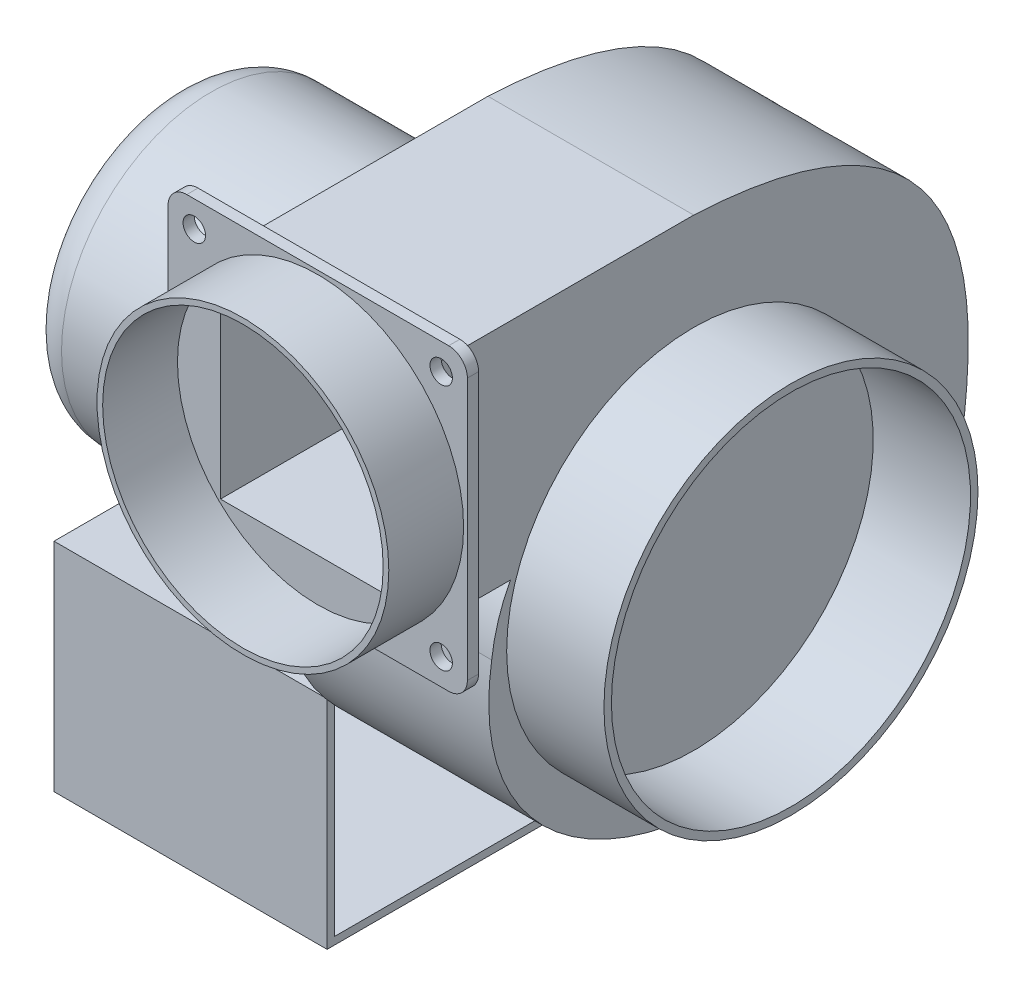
ISO-10303-21;
HEADER;
FILE_DESCRIPTION(('STEP AP214'),'2;1');
FILE_NAME('part.step','',(''),(''),'','','');
FILE_SCHEMA(('AUTOMOTIVE_DESIGN { 1 0 10303 214 1 1 1 1 }'));
ENDSEC;
DATA;
#1=APPLICATION_CONTEXT('core data for automotive mechanical design processes');
#2=APPLICATION_PROTOCOL_DEFINITION('international standard','automotive_design',2000,#1);
#3=PRODUCT_CONTEXT('',#1,'mechanical');
#4=PRODUCT('Part','Part','',(#3));
#5=PRODUCT_RELATED_PRODUCT_CATEGORY('part','',(#4));
#6=PRODUCT_DEFINITION_FORMATION('','',#4);
#7=PRODUCT_DEFINITION_CONTEXT('part definition',#1,'design');
#8=PRODUCT_DEFINITION('design','',#6,#7);
#9=PRODUCT_DEFINITION_SHAPE('','',#8);
#10=(LENGTH_UNIT() NAMED_UNIT(*) SI_UNIT(.MILLI.,.METRE.));
#11=(NAMED_UNIT(*) PLANE_ANGLE_UNIT() SI_UNIT($,.RADIAN.));
#12=(NAMED_UNIT(*) SI_UNIT($,.STERADIAN.) SOLID_ANGLE_UNIT());
#13=UNCERTAINTY_MEASURE_WITH_UNIT(LENGTH_MEASURE(1.E-05),#10,'distance_accuracy_value','');
#14=(GEOMETRIC_REPRESENTATION_CONTEXT(3) GLOBAL_UNCERTAINTY_ASSIGNED_CONTEXT((#13)) GLOBAL_UNIT_ASSIGNED_CONTEXT((#10,
#11,#12)) REPRESENTATION_CONTEXT('',''));
#15=CARTESIAN_POINT('',(0.,0.,0.));
#16=DIRECTION('',(0.,0.,1.));
#17=DIRECTION('',(1.,0.,0.));
#18=AXIS2_PLACEMENT_3D('',#15,#16,#17);
#19=CARTESIAN_POINT('',(-73.,0.,0.));
#20=DIRECTION('',(-1.,0.,0.));
#21=DIRECTION('',(0.,0.,1.));
#22=AXIS2_PLACEMENT_3D('',#19,#20,#21);
#23=PLANE('',#22);
#24=DIRECTION('',(0.,1.,0.));
#25=VECTOR('',#24,1.);
#26=CARTESIAN_POINT('',(-73.,-42.,43.));
#27=LINE('',#26,#25);
#28=CARTESIAN_POINT('',(-73.,-100.,43.));
#29=VERTEX_POINT('',#28);
#30=CARTESIAN_POINT('',(-73.,-42.,43.));
#31=VERTEX_POINT('',#30);
#32=EDGE_CURVE('E147',#29,#31,#27,.T.);
#33=ORIENTED_EDGE('',*,*,#32,.T.);
#34=DIRECTION('',(0.,0.,-1.));
#35=VECTOR('',#34,1.);
#36=CARTESIAN_POINT('',(-73.,-42.,-43.));
#37=LINE('',#36,#35);
#38=CARTESIAN_POINT('',(-73.,-42.,-43.));
#39=VERTEX_POINT('',#38);
#40=EDGE_CURVE('E150',#31,#39,#37,.T.);
#41=ORIENTED_EDGE('',*,*,#40,.T.);
#42=DIRECTION('',(0.,-1.,0.));
#43=VECTOR('',#42,1.);
#44=CARTESIAN_POINT('',(-73.,-42.,-43.));
#45=LINE('',#44,#43);
#46=CARTESIAN_POINT('',(-73.,-100.,-43.));
#47=VERTEX_POINT('',#46);
#48=EDGE_CURVE('E153',#39,#47,#45,.T.);
#49=ORIENTED_EDGE('',*,*,#48,.T.);
#50=DIRECTION('',(0.,0.,1.));
#51=VECTOR('',#50,1.);
#52=CARTESIAN_POINT('',(-73.,-100.,-43.));
#53=LINE('',#52,#51);
#54=EDGE_CURVE('E155',#47,#29,#53,.T.);
#55=ORIENTED_EDGE('',*,*,#54,.T.);
#56=EDGE_LOOP('',(#33,#41,#49,#55));
#57=FACE_BOUND('',#56,.T.);
#58=DIRECTION('',(0.,0.,1.));
#59=VECTOR('',#58,1.);
#60=CARTESIAN_POINT('',(-73.,-98.,-41.));
#61=LINE('',#60,#59);
#62=CARTESIAN_POINT('',(-73.,-98.,-41.));
#63=VERTEX_POINT('',#62);
#64=CARTESIAN_POINT('',(-73.,-98.,41.));
#65=VERTEX_POINT('',#64);
#66=EDGE_CURVE('E117',#63,#65,#61,.T.);
#67=ORIENTED_EDGE('',*,*,#66,.F.);
#68=DIRECTION('',(0.,-1.,0.));
#69=VECTOR('',#68,1.);
#70=CARTESIAN_POINT('',(-73.,-98.,-41.));
#71=LINE('',#70,#69);
#72=CARTESIAN_POINT('',(-73.,-44.,-41.));
#73=VERTEX_POINT('',#72);
#74=EDGE_CURVE('E109',#73,#63,#71,.T.);
#75=ORIENTED_EDGE('',*,*,#74,.F.);
#76=DIRECTION('',(0.,0.,-1.));
#77=VECTOR('',#76,1.);
#78=CARTESIAN_POINT('',(-73.,-44.,-41.));
#79=LINE('',#78,#77);
#80=CARTESIAN_POINT('',(-73.,-44.,41.));
#81=VERTEX_POINT('',#80);
#82=EDGE_CURVE('E131',#81,#73,#79,.T.);
#83=ORIENTED_EDGE('',*,*,#82,.F.);
#84=DIRECTION('',(0.,1.,0.));
#85=VECTOR('',#84,1.);
#86=CARTESIAN_POINT('',(-73.,-98.,41.));
#87=LINE('',#86,#85);
#88=EDGE_CURVE('E129',#65,#81,#87,.T.);
#89=ORIENTED_EDGE('',*,*,#88,.F.);
#90=EDGE_LOOP('',(#67,#75,#83,#89));
#91=FACE_BOUND('',#90,.T.);
#92=ADVANCED_FACE('F44',(#57,#91),#23,.T.);
#93=CARTESIAN_POINT('',(0.,0.,0.));
#94=DIRECTION('',(-1.,0.,0.));
#95=DIRECTION('',(0.,0.,1.));
#96=AXIS2_PLACEMENT_3D('',#93,#94,#95);
#97=PLANE('',#96);
#98=DIRECTION('',(0.,1.,0.));
#99=VECTOR('',#98,1.);
#100=CARTESIAN_POINT('',(0.,-42.,43.));
#101=LINE('',#100,#99);
#102=CARTESIAN_POINT('',(0.,-100.,43.));
#103=VERTEX_POINT('',#102);
#104=CARTESIAN_POINT('',(0.,-42.,43.));
#105=VERTEX_POINT('',#104);
#106=EDGE_CURVE('E125',#103,#105,#101,.T.);
#107=ORIENTED_EDGE('',*,*,#106,.F.);
#108=DIRECTION('',(0.,0.,1.));
#109=VECTOR('',#108,1.);
#110=CARTESIAN_POINT('',(0.,-100.,-43.));
#111=LINE('',#110,#109);
#112=CARTESIAN_POINT('',(0.,-100.,-43.));
#113=VERTEX_POINT('',#112);
#114=EDGE_CURVE('E151',#113,#103,#111,.T.);
#115=ORIENTED_EDGE('',*,*,#114,.F.);
#116=DIRECTION('',(0.,-1.,0.));
#117=VECTOR('',#116,1.);
#118=CARTESIAN_POINT('',(0.,-42.,-43.));
#119=LINE('',#118,#117);
#120=CARTESIAN_POINT('',(0.,-42.,-43.));
#121=VERTEX_POINT('',#120);
#122=EDGE_CURVE('E162',#121,#113,#119,.T.);
#123=ORIENTED_EDGE('',*,*,#122,.F.);
#124=DIRECTION('',(0.,0.,-1.));
#125=VECTOR('',#124,1.);
#126=CARTESIAN_POINT('',(0.,-42.,-43.));
#127=LINE('',#126,#125);
#128=EDGE_CURVE('E160',#105,#121,#127,.T.);
#129=ORIENTED_EDGE('',*,*,#128,.F.);
#130=EDGE_LOOP('',(#107,#115,#123,#129));
#131=FACE_BOUND('',#130,.T.);
#132=DIRECTION('',(0.,-1.,0.));
#133=VECTOR('',#132,1.);
#134=CARTESIAN_POINT('',(0.,-98.,-41.));
#135=LINE('',#134,#133);
#136=CARTESIAN_POINT('',(0.,-44.,-41.));
#137=VERTEX_POINT('',#136);
#138=CARTESIAN_POINT('',(0.,-98.,-41.));
#139=VERTEX_POINT('',#138);
#140=EDGE_CURVE('E67',#137,#139,#135,.T.);
#141=ORIENTED_EDGE('',*,*,#140,.T.);
#142=DIRECTION('',(0.,0.,1.));
#143=VECTOR('',#142,1.);
#144=CARTESIAN_POINT('',(0.,-98.,-41.));
#145=LINE('',#144,#143);
#146=CARTESIAN_POINT('',(0.,-98.,41.));
#147=VERTEX_POINT('',#146);
#148=EDGE_CURVE('E124',#139,#147,#145,.T.);
#149=ORIENTED_EDGE('',*,*,#148,.T.);
#150=DIRECTION('',(0.,1.,0.));
#151=VECTOR('',#150,1.);
#152=CARTESIAN_POINT('',(0.,-98.,41.));
#153=LINE('',#152,#151);
#154=CARTESIAN_POINT('',(0.,-44.,41.));
#155=VERTEX_POINT('',#154);
#156=EDGE_CURVE('E139',#147,#155,#153,.T.);
#157=ORIENTED_EDGE('',*,*,#156,.T.);
#158=DIRECTION('',(0.,0.,-1.));
#159=VECTOR('',#158,1.);
#160=CARTESIAN_POINT('',(0.,-44.,-41.));
#161=LINE('',#160,#159);
#162=EDGE_CURVE('E118',#155,#137,#161,.T.);
#163=ORIENTED_EDGE('',*,*,#162,.T.);
#164=EDGE_LOOP('',(#141,#149,#157,#163));
#165=FACE_BOUND('',#164,.T.);
#166=ADVANCED_FACE('F180',(#131,#165),#97,.F.);
#167=CARTESIAN_POINT('',(-73.,-42.,43.));
#168=DIRECTION('',(0.,0.,-1.));
#169=DIRECTION('',(-1.,0.,0.));
#170=AXIS2_PLACEMENT_3D('',#167,#168,#169);
#171=PLANE('',#170);
#172=ORIENTED_EDGE('',*,*,#106,.T.);
#173=DIRECTION('',(1.,0.,0.));
#174=VECTOR('',#173,1.);
#175=CARTESIAN_POINT('',(-73.,-42.,43.));
#176=LINE('',#175,#174);
#177=EDGE_CURVE('E12',#31,#105,#176,.T.);
#178=ORIENTED_EDGE('',*,*,#177,.F.);
#179=ORIENTED_EDGE('',*,*,#32,.F.);
#180=DIRECTION('',(1.,0.,0.));
#181=VECTOR('',#180,1.);
#182=CARTESIAN_POINT('',(-73.,-100.,43.));
#183=LINE('',#182,#181);
#184=EDGE_CURVE('E157',#29,#103,#183,.T.);
#185=ORIENTED_EDGE('',*,*,#184,.T.);
#186=EDGE_LOOP('',(#172,#178,#179,#185));
#187=FACE_BOUND('',#186,.T.);
#188=ADVANCED_FACE('F46',(#187),#171,.F.);
#189=CARTESIAN_POINT('',(-73.,-42.,-43.));
#190=DIRECTION('',(0.,-1.,0.));
#191=DIRECTION('',(0.,0.,-1.));
#192=AXIS2_PLACEMENT_3D('',#189,#190,#191);
#193=PLANE('',#192);
#194=ORIENTED_EDGE('',*,*,#128,.T.);
#195=DIRECTION('',(1.,0.,0.));
#196=VECTOR('',#195,1.);
#197=CARTESIAN_POINT('',(-73.,-42.,-43.));
#198=LINE('',#197,#196);
#199=EDGE_CURVE('E52',#39,#121,#198,.T.);
#200=ORIENTED_EDGE('',*,*,#199,.F.);
#201=ORIENTED_EDGE('',*,*,#40,.F.);
#202=ORIENTED_EDGE('',*,*,#177,.T.);
#203=EDGE_LOOP('',(#194,#200,#201,#202));
#204=FACE_BOUND('',#203,.T.);
#205=ADVANCED_FACE('F190',(#204),#193,.F.);
#206=CARTESIAN_POINT('',(-73.,-42.,-43.));
#207=DIRECTION('',(0.,0.,1.));
#208=DIRECTION('',(1.,0.,0.));
#209=AXIS2_PLACEMENT_3D('',#206,#207,#208);
#210=PLANE('',#209);
#211=ORIENTED_EDGE('',*,*,#122,.T.);
#212=DIRECTION('',(1.,0.,0.));
#213=VECTOR('',#212,1.);
#214=CARTESIAN_POINT('',(-73.,-100.,-43.));
#215=LINE('',#214,#213);
#216=EDGE_CURVE('E167',#47,#113,#215,.T.);
#217=ORIENTED_EDGE('',*,*,#216,.F.);
#218=ORIENTED_EDGE('',*,*,#48,.F.);
#219=ORIENTED_EDGE('',*,*,#199,.T.);
#220=EDGE_LOOP('',(#211,#217,#218,#219));
#221=FACE_BOUND('',#220,.T.);
#222=ADVANCED_FACE('F174',(#221),#210,.F.);
#223=CARTESIAN_POINT('',(-73.,-100.,-43.));
#224=DIRECTION('',(0.,1.,0.));
#225=DIRECTION('',(0.,0.,1.));
#226=AXIS2_PLACEMENT_3D('',#223,#224,#225);
#227=PLANE('',#226);
#228=CARTESIAN_POINT('',(-53.,-100.,-27.5));
#229=DIRECTION('',(0.,-1.,0.));
#230=DIRECTION('',(0.,0.,-1.));
#231=AXIS2_PLACEMENT_3D('',#228,#229,#230);
#232=CIRCLE('',#231,3.);
#233=CARTESIAN_POINT('',(-53.,-100.,-30.5));
#234=VERTEX_POINT('',#233);
#235=EDGE_CURVE('E214',#234,#234,#232,.T.);
#236=ORIENTED_EDGE('',*,*,#235,.F.);
#237=EDGE_LOOP('',(#236));
#238=FACE_BOUND('',#237,.T.);
#239=CARTESIAN_POINT('',(-20.,-100.,-27.5));
#240=DIRECTION('',(0.,-1.,0.));
#241=DIRECTION('',(0.,0.,-1.));
#242=AXIS2_PLACEMENT_3D('',#239,#240,#241);
#243=CIRCLE('',#242,3.);
#244=CARTESIAN_POINT('',(-20.,-100.,-30.5));
#245=VERTEX_POINT('',#244);
#246=EDGE_CURVE('E218',#245,#245,#243,.T.);
#247=ORIENTED_EDGE('',*,*,#246,.F.);
#248=EDGE_LOOP('',(#247));
#249=FACE_BOUND('',#248,.T.);
#250=CARTESIAN_POINT('',(-20.,-100.,27.5));
#251=DIRECTION('',(0.,-1.,0.));
#252=DIRECTION('',(0.,0.,-1.));
#253=AXIS2_PLACEMENT_3D('',#250,#251,#252);
#254=CIRCLE('',#253,3.);
#255=CARTESIAN_POINT('',(-20.,-100.,24.5));
#256=VERTEX_POINT('',#255);
#257=EDGE_CURVE('E222',#256,#256,#254,.T.);
#258=ORIENTED_EDGE('',*,*,#257,.F.);
#259=EDGE_LOOP('',(#258));
#260=FACE_BOUND('',#259,.T.);
#261=CARTESIAN_POINT('',(-53.,-100.,27.5));
#262=DIRECTION('',(0.,-1.,0.));
#263=DIRECTION('',(0.,0.,-1.));
#264=AXIS2_PLACEMENT_3D('',#261,#262,#263);
#265=CIRCLE('',#264,3.);
#266=CARTESIAN_POINT('',(-53.,-100.,24.5));
#267=VERTEX_POINT('',#266);
#268=EDGE_CURVE('E225',#267,#267,#265,.T.);
#269=ORIENTED_EDGE('',*,*,#268,.F.);
#270=EDGE_LOOP('',(#269));
#271=FACE_BOUND('',#270,.T.);
#272=ORIENTED_EDGE('',*,*,#114,.T.);
#273=ORIENTED_EDGE('',*,*,#184,.F.);
#274=ORIENTED_EDGE('',*,*,#54,.F.);
#275=ORIENTED_EDGE('',*,*,#216,.T.);
#276=EDGE_LOOP('',(#272,#273,#274,#275));
#277=FACE_BOUND('',#276,.T.);
#278=ADVANCED_FACE('F184',(#238,#249,#260,#271,#277),#227,.F.);
#279=CARTESIAN_POINT('',(-73.,-98.,-41.));
#280=DIRECTION('',(0.,0.,1.));
#281=DIRECTION('',(1.,0.,0.));
#282=AXIS2_PLACEMENT_3D('',#279,#280,#281);
#283=PLANE('',#282);
#284=ORIENTED_EDGE('',*,*,#140,.F.);
#285=DIRECTION('',(1.,0.,0.));
#286=VECTOR('',#285,1.);
#287=CARTESIAN_POINT('',(-73.,-44.,-41.));
#288=LINE('',#287,#286);
#289=EDGE_CURVE('E113',#73,#137,#288,.T.);
#290=ORIENTED_EDGE('',*,*,#289,.F.);
#291=ORIENTED_EDGE('',*,*,#74,.T.);
#292=DIRECTION('',(1.,0.,0.));
#293=VECTOR('',#292,1.);
#294=CARTESIAN_POINT('',(-73.,-98.,-41.));
#295=LINE('',#294,#293);
#296=EDGE_CURVE('E112',#63,#139,#295,.T.);
#297=ORIENTED_EDGE('',*,*,#296,.T.);
#298=EDGE_LOOP('',(#284,#290,#291,#297));
#299=FACE_BOUND('',#298,.T.);
#300=ADVANCED_FACE('F111',(#299),#283,.T.);
#301=CARTESIAN_POINT('',(-73.,-98.,-41.));
#302=DIRECTION('',(0.,1.,0.));
#303=DIRECTION('',(0.,0.,1.));
#304=AXIS2_PLACEMENT_3D('',#301,#302,#303);
#305=PLANE('',#304);
#306=CARTESIAN_POINT('',(-53.,-98.,-27.5));
#307=DIRECTION('',(0.,-1.,0.));
#308=DIRECTION('',(0.,0.,-1.));
#309=AXIS2_PLACEMENT_3D('',#306,#307,#308);
#310=CIRCLE('',#309,3.);
#311=CARTESIAN_POINT('',(-53.,-98.,-30.5));
#312=VERTEX_POINT('',#311);
#313=EDGE_CURVE('E236',#312,#312,#310,.T.);
#314=ORIENTED_EDGE('',*,*,#313,.T.);
#315=EDGE_LOOP('',(#314));
#316=FACE_BOUND('',#315,.T.);
#317=CARTESIAN_POINT('',(-20.,-98.,-27.5));
#318=DIRECTION('',(0.,-1.,0.));
#319=DIRECTION('',(0.,0.,-1.));
#320=AXIS2_PLACEMENT_3D('',#317,#318,#319);
#321=CIRCLE('',#320,3.);
#322=CARTESIAN_POINT('',(-20.,-98.,-30.5));
#323=VERTEX_POINT('',#322);
#324=EDGE_CURVE('E233',#323,#323,#321,.T.);
#325=ORIENTED_EDGE('',*,*,#324,.T.);
#326=EDGE_LOOP('',(#325));
#327=FACE_BOUND('',#326,.T.);
#328=CARTESIAN_POINT('',(-20.,-98.,27.5));
#329=DIRECTION('',(0.,-1.,0.));
#330=DIRECTION('',(0.,0.,-1.));
#331=AXIS2_PLACEMENT_3D('',#328,#329,#330);
#332=CIRCLE('',#331,3.);
#333=CARTESIAN_POINT('',(-20.,-98.,24.5));
#334=VERTEX_POINT('',#333);
#335=EDGE_CURVE('E227',#334,#334,#332,.T.);
#336=ORIENTED_EDGE('',*,*,#335,.T.);
#337=EDGE_LOOP('',(#336));
#338=FACE_BOUND('',#337,.T.);
#339=CARTESIAN_POINT('',(-53.,-98.,27.5));
#340=DIRECTION('',(0.,-1.,0.));
#341=DIRECTION('',(0.,0.,-1.));
#342=AXIS2_PLACEMENT_3D('',#339,#340,#341);
#343=CIRCLE('',#342,3.);
#344=CARTESIAN_POINT('',(-53.,-98.,24.5));
#345=VERTEX_POINT('',#344);
#346=EDGE_CURVE('E137',#345,#345,#343,.T.);
#347=ORIENTED_EDGE('',*,*,#346,.T.);
#348=EDGE_LOOP('',(#347));
#349=FACE_BOUND('',#348,.T.);
#350=ORIENTED_EDGE('',*,*,#148,.F.);
#351=ORIENTED_EDGE('',*,*,#296,.F.);
#352=ORIENTED_EDGE('',*,*,#66,.T.);
#353=DIRECTION('',(1.,0.,0.));
#354=VECTOR('',#353,1.);
#355=CARTESIAN_POINT('',(-73.,-98.,41.));
#356=LINE('',#355,#354);
#357=EDGE_CURVE('E126',#65,#147,#356,.T.);
#358=ORIENTED_EDGE('',*,*,#357,.T.);
#359=EDGE_LOOP('',(#350,#351,#352,#358));
#360=FACE_BOUND('',#359,.T.);
#361=ADVANCED_FACE('F121',(#316,#327,#338,#349,#360),#305,.T.);
#362=CARTESIAN_POINT('',(-73.,-98.,41.));
#363=DIRECTION('',(0.,0.,-1.));
#364=DIRECTION('',(-1.,0.,0.));
#365=AXIS2_PLACEMENT_3D('',#362,#363,#364);
#366=PLANE('',#365);
#367=ORIENTED_EDGE('',*,*,#156,.F.);
#368=ORIENTED_EDGE('',*,*,#357,.F.);
#369=ORIENTED_EDGE('',*,*,#88,.T.);
#370=DIRECTION('',(1.,0.,0.));
#371=VECTOR('',#370,1.);
#372=CARTESIAN_POINT('',(-73.,-44.,41.));
#373=LINE('',#372,#371);
#374=EDGE_CURVE('E59',#81,#155,#373,.T.);
#375=ORIENTED_EDGE('',*,*,#374,.T.);
#376=EDGE_LOOP('',(#367,#368,#369,#375));
#377=FACE_BOUND('',#376,.T.);
#378=ADVANCED_FACE('F267',(#377),#366,.T.);
#379=CARTESIAN_POINT('',(-73.,-44.,-41.));
#380=DIRECTION('',(0.,-1.,0.));
#381=DIRECTION('',(0.,0.,-1.));
#382=AXIS2_PLACEMENT_3D('',#379,#380,#381);
#383=PLANE('',#382);
#384=ORIENTED_EDGE('',*,*,#162,.F.);
#385=ORIENTED_EDGE('',*,*,#374,.F.);
#386=ORIENTED_EDGE('',*,*,#82,.T.);
#387=ORIENTED_EDGE('',*,*,#289,.T.);
#388=EDGE_LOOP('',(#384,#385,#386,#387));
#389=FACE_BOUND('',#388,.T.);
#390=ADVANCED_FACE('F263',(#389),#383,.T.);
#391=CARTESIAN_POINT('',(-53.,-98.,27.5));
#392=DIRECTION('',(0.,-1.,0.));
#393=DIRECTION('',(0.,0.,-1.));
#394=AXIS2_PLACEMENT_3D('',#391,#392,#393);
#395=CYLINDRICAL_SURFACE('',#394,3.);
#396=ORIENTED_EDGE('',*,*,#346,.F.);
#397=EDGE_LOOP('',(#396));
#398=FACE_BOUND('',#397,.T.);
#399=ORIENTED_EDGE('',*,*,#268,.T.);
#400=EDGE_LOOP('',(#399));
#401=FACE_BOUND('',#400,.T.);
#402=ADVANCED_FACE('F259',(#398,#401),#395,.F.);
#403=CARTESIAN_POINT('',(-20.,-98.,27.5));
#404=DIRECTION('',(0.,-1.,0.));
#405=DIRECTION('',(0.,0.,-1.));
#406=AXIS2_PLACEMENT_3D('',#403,#404,#405);
#407=CYLINDRICAL_SURFACE('',#406,3.);
#408=ORIENTED_EDGE('',*,*,#335,.F.);
#409=EDGE_LOOP('',(#408));
#410=FACE_BOUND('',#409,.T.);
#411=ORIENTED_EDGE('',*,*,#257,.T.);
#412=EDGE_LOOP('',(#411));
#413=FACE_BOUND('',#412,.T.);
#414=ADVANCED_FACE('F253',(#410,#413),#407,.F.);
#415=CARTESIAN_POINT('',(-20.,-98.,-27.5));
#416=DIRECTION('',(0.,-1.,0.));
#417=DIRECTION('',(0.,0.,-1.));
#418=AXIS2_PLACEMENT_3D('',#415,#416,#417);
#419=CYLINDRICAL_SURFACE('',#418,3.);
#420=ORIENTED_EDGE('',*,*,#324,.F.);
#421=EDGE_LOOP('',(#420));
#422=FACE_BOUND('',#421,.T.);
#423=ORIENTED_EDGE('',*,*,#246,.T.);
#424=EDGE_LOOP('',(#423));
#425=FACE_BOUND('',#424,.T.);
#426=ADVANCED_FACE('F248',(#422,#425),#419,.F.);
#427=CARTESIAN_POINT('',(-53.,-98.,-27.5));
#428=DIRECTION('',(0.,-1.,0.));
#429=DIRECTION('',(0.,0.,-1.));
#430=AXIS2_PLACEMENT_3D('',#427,#428,#429);
#431=CYLINDRICAL_SURFACE('',#430,3.);
#432=ORIENTED_EDGE('',*,*,#313,.F.);
#433=EDGE_LOOP('',(#432));
#434=FACE_BOUND('',#433,.T.);
#435=ORIENTED_EDGE('',*,*,#235,.T.);
#436=EDGE_LOOP('',(#435));
#437=FACE_BOUND('',#436,.T.);
#438=ADVANCED_FACE('F245',(#434,#437),#431,.F.);
#439=CLOSED_SHELL('',(#92,#166,#188,#205,#222,#278,#300,#361,#378,#390,#402,#414,#426,#438));
#440=MANIFOLD_SOLID_BREP('B2',#439);
#441=CARTESIAN_POINT('',(81.,0.,0.));
#442=DIRECTION('',(1.,0.,0.));
#443=DIRECTION('',(0.,0.,-1.));
#444=AXIS2_PLACEMENT_3D('',#441,#442,#443);
#445=PLANE('',#444);
#446=CARTESIAN_POINT('',(81.,0.,0.));
#447=DIRECTION('',(1.,0.,0.));
#448=DIRECTION('',(0.,0.,-1.));
#449=AXIS2_PLACEMENT_3D('',#446,#447,#448);
#450=CIRCLE('',#449,50.);
#451=CARTESIAN_POINT('',(81.,0.,50.));
#452=VERTEX_POINT('',#451);
#453=EDGE_CURVE('E43',#452,#452,#450,.T.);
#454=ORIENTED_EDGE('',*,*,#453,.T.);
#455=EDGE_LOOP('',(#454));
#456=FACE_BOUND('',#455,.T.);
#457=CARTESIAN_POINT('',(81.,0.,0.));
#458=DIRECTION('',(1.,0.,0.));
#459=DIRECTION('',(0.,0.,-1.));
#460=AXIS2_PLACEMENT_3D('',#457,#458,#459);
#461=CIRCLE('',#460,48.);
#462=CARTESIAN_POINT('',(81.,0.,48.));
#463=VERTEX_POINT('',#462);
#464=EDGE_CURVE('E377',#463,#463,#461,.T.);
#465=ORIENTED_EDGE('',*,*,#464,.F.);
#466=EDGE_LOOP('',(#465));
#467=FACE_BOUND('',#466,.T.);
#468=ADVANCED_FACE('F366',(#456,#467),#445,.T.);
#469=CARTESIAN_POINT('',(55.,0.,0.));
#470=DIRECTION('',(1.,0.,0.));
#471=DIRECTION('',(0.,0.,-1.));
#472=AXIS2_PLACEMENT_3D('',#469,#470,#471);
#473=PLANE('',#472);
#474=CARTESIAN_POINT('',(55.,0.,0.));
#475=DIRECTION('',(1.,0.,0.));
#476=DIRECTION('',(0.,0.,-1.));
#477=AXIS2_PLACEMENT_3D('',#474,#475,#476);
#478=CIRCLE('',#477,50.);
#479=CARTESIAN_POINT('',(55.,0.,50.));
#480=VERTEX_POINT('',#479);
#481=EDGE_CURVE('E370',#480,#480,#478,.T.);
#482=ORIENTED_EDGE('',*,*,#481,.F.);
#483=EDGE_LOOP('',(#482));
#484=FACE_BOUND('',#483,.T.);
#485=CARTESIAN_POINT('',(55.,0.,0.));
#486=DIRECTION('',(1.,0.,0.));
#487=DIRECTION('',(0.,0.,-1.));
#488=AXIS2_PLACEMENT_3D('',#485,#486,#487);
#489=CIRCLE('',#488,48.);
#490=CARTESIAN_POINT('',(55.,0.,48.));
#491=VERTEX_POINT('',#490);
#492=EDGE_CURVE('E379',#491,#491,#489,.T.);
#493=ORIENTED_EDGE('',*,*,#492,.T.);
#494=EDGE_LOOP('',(#493));
#495=FACE_BOUND('',#494,.T.);
#496=ADVANCED_FACE('F389',(#484,#495),#473,.F.);
#497=CARTESIAN_POINT('',(81.,0.,0.));
#498=DIRECTION('',(-1.,0.,0.));
#499=DIRECTION('',(0.,0.,1.));
#500=AXIS2_PLACEMENT_3D('',#497,#498,#499);
#501=CYLINDRICAL_SURFACE('',#500,50.);
#502=CARTESIAN_POINT('',(81.,0.,50.));
#503=CARTESIAN_POINT('',(80.7291666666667,0.,50.));
#504=CARTESIAN_POINT('',(80.4583333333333,0.,50.));
#505=CARTESIAN_POINT('',(79.9166666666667,0.,50.));
#506=CARTESIAN_POINT('',(79.6458333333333,0.,50.));
#507=CARTESIAN_POINT('',(79.1041666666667,0.,50.));
#508=CARTESIAN_POINT('',(78.8333333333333,0.,50.));
#509=CARTESIAN_POINT('',(78.2916666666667,0.,50.));
#510=CARTESIAN_POINT('',(78.0208333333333,0.,50.));
#511=CARTESIAN_POINT('',(77.4791666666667,0.,50.));
#512=CARTESIAN_POINT('',(77.2083333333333,0.,50.));
#513=CARTESIAN_POINT('',(76.6666666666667,0.,50.));
#514=CARTESIAN_POINT('',(76.3958333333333,0.,50.));
#515=CARTESIAN_POINT('',(75.8541666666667,0.,50.));
#516=CARTESIAN_POINT('',(75.5833333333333,0.,50.));
#517=CARTESIAN_POINT('',(75.0416666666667,0.,50.));
#518=CARTESIAN_POINT('',(74.7708333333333,0.,50.));
#519=CARTESIAN_POINT('',(74.2291666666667,0.,50.));
#520=CARTESIAN_POINT('',(73.9583333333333,0.,50.));
#521=CARTESIAN_POINT('',(73.4166666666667,0.,50.));
#522=CARTESIAN_POINT('',(73.1458333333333,0.,50.));
#523=CARTESIAN_POINT('',(72.6041666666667,0.,50.));
#524=CARTESIAN_POINT('',(72.3333333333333,0.,50.));
#525=CARTESIAN_POINT('',(71.7916666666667,0.,50.));
#526=CARTESIAN_POINT('',(71.5208333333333,0.,50.));
#527=CARTESIAN_POINT('',(70.9791666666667,0.,50.));
#528=CARTESIAN_POINT('',(70.7083333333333,0.,50.));
#529=CARTESIAN_POINT('',(70.1666666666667,0.,50.));
#530=CARTESIAN_POINT('',(69.8958333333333,0.,50.));
#531=CARTESIAN_POINT('',(69.3541666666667,0.,50.));
#532=CARTESIAN_POINT('',(69.0833333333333,0.,50.));
#533=CARTESIAN_POINT('',(68.5416666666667,0.,50.));
#534=CARTESIAN_POINT('',(68.2708333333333,0.,50.));
#535=CARTESIAN_POINT('',(67.7291666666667,0.,50.));
#536=CARTESIAN_POINT('',(67.4583333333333,0.,50.));
#537=CARTESIAN_POINT('',(66.9166666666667,0.,50.));
#538=CARTESIAN_POINT('',(66.6458333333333,0.,50.));
#539=CARTESIAN_POINT('',(66.1041666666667,0.,50.));
#540=CARTESIAN_POINT('',(65.8333333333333,0.,50.));
#541=CARTESIAN_POINT('',(65.2916666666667,0.,50.));
#542=CARTESIAN_POINT('',(65.0208333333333,0.,50.));
#543=CARTESIAN_POINT('',(64.4791666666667,0.,50.));
#544=CARTESIAN_POINT('',(64.2083333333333,0.,50.));
#545=CARTESIAN_POINT('',(63.6666666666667,0.,50.));
#546=CARTESIAN_POINT('',(63.3958333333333,0.,50.));
#547=CARTESIAN_POINT('',(62.8541666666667,0.,50.));
#548=CARTESIAN_POINT('',(62.5833333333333,0.,50.));
#549=CARTESIAN_POINT('',(62.0416666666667,0.,50.));
#550=CARTESIAN_POINT('',(61.7708333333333,0.,50.));
#551=CARTESIAN_POINT('',(61.2291666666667,0.,50.));
#552=CARTESIAN_POINT('',(60.9583333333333,0.,50.));
#553=CARTESIAN_POINT('',(60.4166666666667,0.,50.));
#554=CARTESIAN_POINT('',(60.1458333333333,0.,50.));
#555=CARTESIAN_POINT('',(59.6041666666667,0.,50.));
#556=CARTESIAN_POINT('',(59.3333333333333,0.,50.));
#557=CARTESIAN_POINT('',(58.7916666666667,0.,50.));
#558=CARTESIAN_POINT('',(58.5208333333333,0.,50.));
#559=CARTESIAN_POINT('',(57.9791666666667,0.,50.));
#560=CARTESIAN_POINT('',(57.7083333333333,0.,50.));
#561=CARTESIAN_POINT('',(57.1666666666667,0.,50.));
#562=CARTESIAN_POINT('',(56.8958333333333,0.,50.));
#563=CARTESIAN_POINT('',(56.3541666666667,0.,50.));
#564=CARTESIAN_POINT('',(56.0833333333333,0.,50.));
#565=CARTESIAN_POINT('',(55.5416666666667,0.,50.));
#566=CARTESIAN_POINT('',(55.2708333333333,0.,50.));
#567=CARTESIAN_POINT('',(55.,0.,50.));
#568=B_SPLINE_CURVE_WITH_KNOTS('',3,(#502,#503,#504,#505,#506,#507,#508,#509,#510,#511,#512,
#513,#514,#515,#516,#517,#518,#519,#520,#521,#522,#523,#524,#525,#526,#527,#528,#529,#530,#531,
#532,#533,#534,#535,#536,#537,#538,#539,#540,#541,#542,#543,#544,#545,#546,#547,#548,#549,#550,
#551,#552,#553,#554,#555,#556,#557,#558,#559,#560,#561,#562,#563,#564,#565,#566,#567),
.UNSPECIFIED.,.F.,.F.,(4,2,2,2,2,2,2,2,2,2,2,2,2,2,2,2,2,2,2,2,2,2,2,2,2,2,2,2,2,2,2,2,4),(0.,
0.812499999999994,1.62499999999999,2.4375,3.24999999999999,4.0625,4.87499999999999,5.6875,
6.49999999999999,7.3125,8.12499999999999,8.93749999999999,9.74999999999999,10.5625,11.375,
12.1875,13.,13.8125,14.625,15.4375,16.25,17.0625,17.875,18.6875,19.5,20.3125,21.125,21.9375,
22.75,23.5625,24.375,25.1875,26.),.UNSPECIFIED.);
#569=EDGE_CURVE('BSEAM368',#452,#480,#568,.T.);
#570=ORIENTED_EDGE('',*,*,#453,.F.);
#571=ORIENTED_EDGE('',*,*,#481,.T.);
#572=ORIENTED_EDGE('',*,*,#569,.T.);
#573=ORIENTED_EDGE('',*,*,#569,.F.);
#574=EDGE_LOOP('',(#570,#572,#571,#573));
#575=FACE_BOUND('',#574,.T.);
#576=ADVANCED_FACE('F368',(#575),#501,.T.);
#577=CARTESIAN_POINT('',(81.,0.,0.));
#578=DIRECTION('',(-1.,0.,0.));
#579=DIRECTION('',(0.,0.,1.));
#580=AXIS2_PLACEMENT_3D('',#577,#578,#579);
#581=CYLINDRICAL_SURFACE('',#580,48.);
#582=CARTESIAN_POINT('',(81.,0.,48.));
#583=CARTESIAN_POINT('',(80.7291666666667,0.,48.));
#584=CARTESIAN_POINT('',(80.4583333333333,0.,48.));
#585=CARTESIAN_POINT('',(79.9166666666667,0.,48.));
#586=CARTESIAN_POINT('',(79.6458333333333,0.,48.));
#587=CARTESIAN_POINT('',(79.1041666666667,0.,48.));
#588=CARTESIAN_POINT('',(78.8333333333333,0.,48.));
#589=CARTESIAN_POINT('',(78.2916666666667,0.,48.));
#590=CARTESIAN_POINT('',(78.0208333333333,0.,48.));
#591=CARTESIAN_POINT('',(77.4791666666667,0.,48.));
#592=CARTESIAN_POINT('',(77.2083333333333,0.,48.));
#593=CARTESIAN_POINT('',(76.6666666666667,0.,48.));
#594=CARTESIAN_POINT('',(76.3958333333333,0.,48.));
#595=CARTESIAN_POINT('',(75.8541666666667,0.,48.));
#596=CARTESIAN_POINT('',(75.5833333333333,0.,48.));
#597=CARTESIAN_POINT('',(75.0416666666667,0.,48.));
#598=CARTESIAN_POINT('',(74.7708333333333,0.,48.));
#599=CARTESIAN_POINT('',(74.2291666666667,0.,48.));
#600=CARTESIAN_POINT('',(73.9583333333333,0.,48.));
#601=CARTESIAN_POINT('',(73.4166666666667,0.,48.));
#602=CARTESIAN_POINT('',(73.1458333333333,0.,48.));
#603=CARTESIAN_POINT('',(72.6041666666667,0.,48.));
#604=CARTESIAN_POINT('',(72.3333333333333,0.,48.));
#605=CARTESIAN_POINT('',(71.7916666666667,0.,48.));
#606=CARTESIAN_POINT('',(71.5208333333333,0.,48.));
#607=CARTESIAN_POINT('',(70.9791666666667,0.,48.));
#608=CARTESIAN_POINT('',(70.7083333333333,0.,48.));
#609=CARTESIAN_POINT('',(70.1666666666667,0.,48.));
#610=CARTESIAN_POINT('',(69.8958333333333,0.,48.));
#611=CARTESIAN_POINT('',(69.3541666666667,0.,48.));
#612=CARTESIAN_POINT('',(69.0833333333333,0.,48.));
#613=CARTESIAN_POINT('',(68.5416666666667,0.,48.));
#614=CARTESIAN_POINT('',(68.2708333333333,0.,48.));
#615=CARTESIAN_POINT('',(67.7291666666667,0.,48.));
#616=CARTESIAN_POINT('',(67.4583333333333,0.,48.));
#617=CARTESIAN_POINT('',(66.9166666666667,0.,48.));
#618=CARTESIAN_POINT('',(66.6458333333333,0.,48.));
#619=CARTESIAN_POINT('',(66.1041666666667,0.,48.));
#620=CARTESIAN_POINT('',(65.8333333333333,0.,48.));
#621=CARTESIAN_POINT('',(65.2916666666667,0.,48.));
#622=CARTESIAN_POINT('',(65.0208333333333,0.,48.));
#623=CARTESIAN_POINT('',(64.4791666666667,0.,48.));
#624=CARTESIAN_POINT('',(64.2083333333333,0.,48.));
#625=CARTESIAN_POINT('',(63.6666666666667,0.,48.));
#626=CARTESIAN_POINT('',(63.3958333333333,0.,48.));
#627=CARTESIAN_POINT('',(62.8541666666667,0.,48.));
#628=CARTESIAN_POINT('',(62.5833333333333,0.,48.));
#629=CARTESIAN_POINT('',(62.0416666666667,0.,48.));
#630=CARTESIAN_POINT('',(61.7708333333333,0.,48.));
#631=CARTESIAN_POINT('',(61.2291666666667,0.,48.));
#632=CARTESIAN_POINT('',(60.9583333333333,0.,48.));
#633=CARTESIAN_POINT('',(60.4166666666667,0.,48.));
#634=CARTESIAN_POINT('',(60.1458333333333,0.,48.));
#635=CARTESIAN_POINT('',(59.6041666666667,0.,48.));
#636=CARTESIAN_POINT('',(59.3333333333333,0.,48.));
#637=CARTESIAN_POINT('',(58.7916666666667,0.,48.));
#638=CARTESIAN_POINT('',(58.5208333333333,0.,48.));
#639=CARTESIAN_POINT('',(57.9791666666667,0.,48.));
#640=CARTESIAN_POINT('',(57.7083333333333,0.,48.));
#641=CARTESIAN_POINT('',(57.1666666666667,0.,48.));
#642=CARTESIAN_POINT('',(56.8958333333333,0.,48.));
#643=CARTESIAN_POINT('',(56.3541666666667,0.,48.));
#644=CARTESIAN_POINT('',(56.0833333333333,0.,48.));
#645=CARTESIAN_POINT('',(55.5416666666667,0.,48.));
#646=CARTESIAN_POINT('',(55.2708333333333,0.,48.));
#647=CARTESIAN_POINT('',(55.,0.,48.));
#648=B_SPLINE_CURVE_WITH_KNOTS('',3,(#582,#583,#584,#585,#586,#587,#588,#589,#590,#591,#592,
#593,#594,#595,#596,#597,#598,#599,#600,#601,#602,#603,#604,#605,#606,#607,#608,#609,#610,#611,
#612,#613,#614,#615,#616,#617,#618,#619,#620,#621,#622,#623,#624,#625,#626,#627,#628,#629,#630,
#631,#632,#633,#634,#635,#636,#637,#638,#639,#640,#641,#642,#643,#644,#645,#646,#647),
.UNSPECIFIED.,.F.,.F.,(4,2,2,2,2,2,2,2,2,2,2,2,2,2,2,2,2,2,2,2,2,2,2,2,2,2,2,2,2,2,2,2,4),(0.,
0.812500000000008,1.625,2.43750000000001,3.25,4.06250000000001,4.875,5.68750000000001,
6.50000000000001,7.31250000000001,8.12500000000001,8.9375,9.75000000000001,10.5625,11.375,
12.1875,13.,13.8125,14.625,15.4375,16.25,17.0625,17.875,18.6875,19.5,20.3125,21.125,21.9375,
22.75,23.5625,24.375,25.1875,26.),.UNSPECIFIED.);
#649=EDGE_CURVE('BSEAM385',#463,#491,#648,.T.);
#650=ORIENTED_EDGE('',*,*,#464,.T.);
#651=ORIENTED_EDGE('',*,*,#492,.F.);
#652=ORIENTED_EDGE('',*,*,#649,.T.);
#653=ORIENTED_EDGE('',*,*,#649,.F.);
#654=EDGE_LOOP('',(#650,#652,#651,#653));
#655=FACE_BOUND('',#654,.T.);
#656=ADVANCED_FACE('F385',(#655),#581,.F.);
#657=CLOSED_SHELL('',(#468,#496,#576,#656));
#658=MANIFOLD_SOLID_BREP('B6',#657);
#659=CARTESIAN_POINT('',(27.5,46.,93.));
#660=DIRECTION('',(0.,0.,1.));
#661=DIRECTION('',(1.,0.,0.));
#662=AXIS2_PLACEMENT_3D('',#659,#660,#661);
#663=PLANE('',#662);
#664=CARTESIAN_POINT('',(27.5,46.,93.));
#665=DIRECTION('',(0.,0.,1.));
#666=DIRECTION('',(1.,0.,0.));
#667=AXIS2_PLACEMENT_3D('',#664,#665,#666);
#668=CIRCLE('',#667,39.);
#669=CARTESIAN_POINT('',(66.5,46.,93.));
#670=VERTEX_POINT('',#669);
#671=EDGE_CURVE('E365',#670,#670,#668,.T.);
#672=ORIENTED_EDGE('',*,*,#671,.T.);
#673=EDGE_LOOP('',(#672));
#674=FACE_BOUND('',#673,.T.);
#675=CARTESIAN_POINT('',(27.5,46.,93.));
#676=DIRECTION('',(0.,0.,1.));
#677=DIRECTION('',(1.,0.,0.));
#678=AXIS2_PLACEMENT_3D('',#675,#676,#677);
#679=CIRCLE('',#678,37.5);
#680=CARTESIAN_POINT('',(65.,46.,93.));
#681=VERTEX_POINT('',#680);
#682=EDGE_CURVE('E448',#681,#681,#679,.T.);
#683=ORIENTED_EDGE('',*,*,#682,.F.);
#684=EDGE_LOOP('',(#683));
#685=FACE_BOUND('',#684,.T.);
#686=ADVANCED_FACE('F437',(#674,#685),#663,.T.);
#687=CARTESIAN_POINT('',(27.5,46.,73.));
#688=DIRECTION('',(0.,0.,1.));
#689=DIRECTION('',(1.,0.,0.));
#690=AXIS2_PLACEMENT_3D('',#687,#688,#689);
#691=PLANE('',#690);
#692=CARTESIAN_POINT('',(27.5,46.,73.));
#693=DIRECTION('',(0.,0.,1.));
#694=DIRECTION('',(1.,0.,0.));
#695=AXIS2_PLACEMENT_3D('',#692,#693,#694);
#696=CIRCLE('',#695,39.);
#697=CARTESIAN_POINT('',(66.5,46.,73.));
#698=VERTEX_POINT('',#697);
#699=EDGE_CURVE('E441',#698,#698,#696,.T.);
#700=ORIENTED_EDGE('',*,*,#699,.F.);
#701=EDGE_LOOP('',(#700));
#702=FACE_BOUND('',#701,.T.);
#703=CARTESIAN_POINT('',(27.5,46.,73.));
#704=DIRECTION('',(0.,0.,1.));
#705=DIRECTION('',(1.,0.,0.));
#706=AXIS2_PLACEMENT_3D('',#703,#704,#705);
#707=CIRCLE('',#706,37.5);
#708=CARTESIAN_POINT('',(65.,46.,73.));
#709=VERTEX_POINT('',#708);
#710=EDGE_CURVE('E450',#709,#709,#707,.T.);
#711=ORIENTED_EDGE('',*,*,#710,.T.);
#712=EDGE_LOOP('',(#711));
#713=FACE_BOUND('',#712,.T.);
#714=ADVANCED_FACE('F460',(#702,#713),#691,.F.);
#715=CARTESIAN_POINT('',(27.5,46.,93.));
#716=DIRECTION('',(0.,0.,-1.));
#717=DIRECTION('',(-1.,0.,0.));
#718=AXIS2_PLACEMENT_3D('',#715,#716,#717);
#719=CYLINDRICAL_SURFACE('',#718,39.);
#720=ORIENTED_EDGE('',*,*,#671,.F.);
#721=EDGE_LOOP('',(#720));
#722=FACE_BOUND('',#721,.T.);
#723=ORIENTED_EDGE('',*,*,#699,.T.);
#724=EDGE_LOOP('',(#723));
#725=FACE_BOUND('',#724,.T.);
#726=ADVANCED_FACE('F439',(#722,#725),#719,.T.);
#727=CARTESIAN_POINT('',(27.5,46.,93.));
#728=DIRECTION('',(0.,0.,-1.));
#729=DIRECTION('',(-1.,0.,0.));
#730=AXIS2_PLACEMENT_3D('',#727,#728,#729);
#731=CYLINDRICAL_SURFACE('',#730,37.5);
#732=ORIENTED_EDGE('',*,*,#682,.T.);
#733=EDGE_LOOP('',(#732));
#734=FACE_BOUND('',#733,.T.);
#735=ORIENTED_EDGE('',*,*,#710,.F.);
#736=EDGE_LOOP('',(#735));
#737=FACE_BOUND('',#736,.T.);
#738=ADVANCED_FACE('F456',(#734,#737),#731,.F.);
#739=CLOSED_SHELL('',(#686,#714,#726,#738));
#740=MANIFOLD_SOLID_BREP('B38',#739);
#741=CARTESIAN_POINT('',(0.,55.141160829,-57.7296176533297));
#742=DIRECTION('',(-1.,0.,0.));
#743=DIRECTION('',(0.,0.,1.));
#744=AXIS2_PLACEMENT_3D('',#741,#742,#743);
#745=PLANE('',#744);
#746=CARTESIAN_POINT('',(0.,0.,-73.));
#747=CARTESIAN_POINT('',(0.,72.282321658,-78.9592353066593));
#748=CARTESIAN_POINT('',(0.,76.,0.));
#749=B_SPLINE_CURVE_WITH_KNOTS('',2,(#746,#747,#748),.UNSPECIFIED.,.F.,.F.,(3,3),(0.,1.),.UNSPECIFIED.);
#750=CARTESIAN_POINT('',(0.,0.,-73.));
#751=VERTEX_POINT('',#750);
#752=CARTESIAN_POINT('',(0.,76.,0.));
#753=VERTEX_POINT('',#752);
#754=EDGE_CURVE('E876',#751,#753,#749,.T.);
#755=ORIENTED_EDGE('',*,*,#754,.F.);
#756=CARTESIAN_POINT('',(0.,0.,54.));
#757=CARTESIAN_POINT('',(0.,-77.158464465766,66.125283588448));
#758=CARTESIAN_POINT('',(0.,-91.4045872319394,-67.4223735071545));
#759=CARTESIAN_POINT('',(0.,0.,-73.));
#760=B_SPLINE_CURVE_WITH_KNOTS('',3,(#756,#757,#758,#759),.UNSPECIFIED.,.F.,.F.,(4,4),(0.,1.),.UNSPECIFIED.);
#761=CARTESIAN_POINT('',(0.,0.,54.));
#762=VERTEX_POINT('',#761);
#763=EDGE_CURVE('E547',#762,#751,#760,.T.);
#764=ORIENTED_EDGE('',*,*,#763,.F.);
#765=CARTESIAN_POINT('',(0.,16.,49.));
#766=CARTESIAN_POINT('',(0.,8.45455465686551,53.0359834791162));
#767=CARTESIAN_POINT('',(0.,0.,54.));
#768=B_SPLINE_CURVE_WITH_KNOTS('',2,(#765,#766,#767),.UNSPECIFIED.,.F.,.F.,(3,3),(0.,1.),.UNSPECIFIED.);
#769=CARTESIAN_POINT('',(0.,16.,49.));
#770=VERTEX_POINT('',#769);
#771=EDGE_CURVE('E890',#770,#762,#768,.T.);
#772=ORIENTED_EDGE('',*,*,#771,.F.);
#773=DIRECTION('',(0.,0.,-1.));
#774=VECTOR('',#773,1.);
#775=CARTESIAN_POINT('',(0.,16.,70.));
#776=LINE('',#775,#774);
#777=CARTESIAN_POINT('',(0.,16.,70.));
#778=VERTEX_POINT('',#777);
#779=EDGE_CURVE('E581',#778,#770,#776,.T.);
#780=ORIENTED_EDGE('',*,*,#779,.F.);
#781=DIRECTION('',(0.,-1.,0.));
#782=VECTOR('',#781,1.);
#783=CARTESIAN_POINT('',(0.,76.,70.));
#784=LINE('',#783,#782);
#785=CARTESIAN_POINT('',(0.,76.,70.));
#786=VERTEX_POINT('',#785);
#787=EDGE_CURVE('E638',#786,#778,#784,.T.);
#788=ORIENTED_EDGE('',*,*,#787,.F.);
#789=DIRECTION('',(0.,0.,1.));
#790=VECTOR('',#789,1.);
#791=CARTESIAN_POINT('',(0.,76.,0.));
#792=LINE('',#791,#790);
#793=EDGE_CURVE('E631',#753,#786,#792,.T.);
#794=ORIENTED_EDGE('',*,*,#793,.F.);
#795=EDGE_LOOP('',(#755,#764,#772,#780,#788,#794));
#796=FACE_BOUND('',#795,.T.);
#797=CARTESIAN_POINT('',(0.,0.,0.));
#798=DIRECTION('',(-1.,0.,0.));
#799=DIRECTION('',(0.,0.,1.));
#800=AXIS2_PLACEMENT_3D('',#797,#798,#799);
#801=CIRCLE('',#800,40.);
#802=CARTESIAN_POINT('',(0.,0.,-40.));
#803=VERTEX_POINT('',#802);
#804=EDGE_CURVE('E745',#803,#803,#801,.T.);
#805=ORIENTED_EDGE('',*,*,#804,.F.);
#806=EDGE_LOOP('',(#805));
#807=FACE_BOUND('',#806,.T.);
#808=ADVANCED_FACE('F499',(#796,#807),#745,.T.);
#809=CARTESIAN_POINT('',(55.,0.,-73.));
#810=CARTESIAN_POINT('',(55.,72.282321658,-78.9592353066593));
#811=CARTESIAN_POINT('',(55.,76.,0.));
#812=B_SPLINE_CURVE_WITH_KNOTS('',2,(#809,#810,#811),.UNSPECIFIED.,.F.,.F.,(3,3),(0.,1.),.UNSPECIFIED.);
#813=DIRECTION('',(-1.,0.,0.));
#814=VECTOR('',#813,1.);
#815=SURFACE_OF_LINEAR_EXTRUSION('',#812,#814);
#816=ORIENTED_EDGE('',*,*,#754,.T.);
#817=DIRECTION('',(-1.,0.,0.));
#818=VECTOR('',#817,1.);
#819=CARTESIAN_POINT('',(55.,76.,0.));
#820=LINE('',#819,#818);
#821=CARTESIAN_POINT('',(55.,76.,0.));
#822=VERTEX_POINT('',#821);
#823=EDGE_CURVE('E635',#822,#753,#820,.T.);
#824=ORIENTED_EDGE('',*,*,#823,.F.);
#825=CARTESIAN_POINT('',(55.,0.,-73.));
#826=VERTEX_POINT('',#825);
#827=EDGE_CURVE('E616',#826,#822,#812,.T.);
#828=ORIENTED_EDGE('',*,*,#827,.F.);
#829=DIRECTION('',(-1.,0.,0.));
#830=VECTOR('',#829,1.);
#831=CARTESIAN_POINT('',(55.,0.,-73.));
#832=LINE('',#831,#830);
#833=EDGE_CURVE('E589',#826,#751,#832,.T.);
#834=ORIENTED_EDGE('',*,*,#833,.T.);
#835=EDGE_LOOP('',(#816,#824,#828,#834));
#836=FACE_BOUND('',#835,.T.);
#837=ADVANCED_FACE('F612',(#836),#815,.F.);
#838=CARTESIAN_POINT('',(55.,76.,0.));
#839=DIRECTION('',(0.,-1.,0.));
#840=DIRECTION('',(0.,0.,-1.));
#841=AXIS2_PLACEMENT_3D('',#838,#839,#840);
#842=PLANE('',#841);
#843=ORIENTED_EDGE('',*,*,#793,.T.);
#844=DIRECTION('',(-1.,0.,0.));
#845=VECTOR('',#844,1.);
#846=CARTESIAN_POINT('',(55.,76.,70.));
#847=LINE('',#846,#845);
#848=CARTESIAN_POINT('',(55.,76.,70.));
#849=VERTEX_POINT('',#848);
#850=EDGE_CURVE('E630',#849,#786,#847,.T.);
#851=ORIENTED_EDGE('',*,*,#850,.F.);
#852=DIRECTION('',(0.,0.,1.));
#853=VECTOR('',#852,1.);
#854=CARTESIAN_POINT('',(55.,76.,0.));
#855=LINE('',#854,#853);
#856=EDGE_CURVE('E556',#822,#849,#855,.T.);
#857=ORIENTED_EDGE('',*,*,#856,.F.);
#858=ORIENTED_EDGE('',*,*,#823,.T.);
#859=EDGE_LOOP('',(#843,#851,#857,#858));
#860=FACE_BOUND('',#859,.T.);
#861=ADVANCED_FACE('F610',(#860),#842,.F.);
#862=CARTESIAN_POINT('',(55.,16.,70.));
#863=DIRECTION('',(0.,1.,0.));
#864=DIRECTION('',(0.,0.,1.));
#865=AXIS2_PLACEMENT_3D('',#862,#863,#864);
#866=PLANE('',#865);
#867=ORIENTED_EDGE('',*,*,#779,.T.);
#868=DIRECTION('',(-1.,0.,0.));
#869=VECTOR('',#868,1.);
#870=CARTESIAN_POINT('',(55.,16.,49.));
#871=LINE('',#870,#869);
#872=CARTESIAN_POINT('',(55.,16.,49.));
#873=VERTEX_POINT('',#872);
#874=EDGE_CURVE('E578',#873,#770,#871,.T.);
#875=ORIENTED_EDGE('',*,*,#874,.F.);
#876=DIRECTION('',(0.,0.,-1.));
#877=VECTOR('',#876,1.);
#878=CARTESIAN_POINT('',(55.,16.,70.));
#879=LINE('',#878,#877);
#880=CARTESIAN_POINT('',(55.,16.,70.));
#881=VERTEX_POINT('',#880);
#882=EDGE_CURVE('E565',#881,#873,#879,.T.);
#883=ORIENTED_EDGE('',*,*,#882,.F.);
#884=DIRECTION('',(-1.,0.,0.));
#885=VECTOR('',#884,1.);
#886=CARTESIAN_POINT('',(55.,16.,70.));
#887=LINE('',#886,#885);
#888=EDGE_CURVE('E584',#881,#778,#887,.T.);
#889=ORIENTED_EDGE('',*,*,#888,.T.);
#890=EDGE_LOOP('',(#867,#875,#883,#889));
#891=FACE_BOUND('',#890,.T.);
#892=ADVANCED_FACE('F579',(#891),#866,.F.);
#893=CARTESIAN_POINT('',(55.,16.,49.));
#894=CARTESIAN_POINT('',(55.,8.45455465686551,53.0359834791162));
#895=CARTESIAN_POINT('',(55.,0.,54.));
#896=B_SPLINE_CURVE_WITH_KNOTS('',2,(#893,#894,#895),.UNSPECIFIED.,.F.,.F.,(3,3),(0.,1.),.UNSPECIFIED.);
#897=DIRECTION('',(-1.,0.,0.));
#898=VECTOR('',#897,1.);
#899=SURFACE_OF_LINEAR_EXTRUSION('',#896,#898);
#900=ORIENTED_EDGE('',*,*,#771,.T.);
#901=DIRECTION('',(-1.,0.,0.));
#902=VECTOR('',#901,1.);
#903=CARTESIAN_POINT('',(55.,0.,54.));
#904=LINE('',#903,#902);
#905=CARTESIAN_POINT('',(55.,0.,54.));
#906=VERTEX_POINT('',#905);
#907=EDGE_CURVE('E585',#906,#762,#904,.T.);
#908=ORIENTED_EDGE('',*,*,#907,.F.);
#909=EDGE_CURVE('E569',#873,#906,#896,.T.);
#910=ORIENTED_EDGE('',*,*,#909,.F.);
#911=ORIENTED_EDGE('',*,*,#874,.T.);
#912=EDGE_LOOP('',(#900,#908,#910,#911));
#913=FACE_BOUND('',#912,.T.);
#914=ADVANCED_FACE('F587',(#913),#899,.F.);
#915=CARTESIAN_POINT('',(55.,0.,54.));
#916=CARTESIAN_POINT('',(55.,-77.158464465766,66.125283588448));
#917=CARTESIAN_POINT('',(55.,-91.4045872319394,-67.4223735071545));
#918=CARTESIAN_POINT('',(55.,0.,-73.));
#919=B_SPLINE_CURVE_WITH_KNOTS('',3,(#915,#916,#917,#918),.UNSPECIFIED.,.F.,.F.,(4,4),(0.,1.),.UNSPECIFIED.);
#920=DIRECTION('',(-1.,0.,0.));
#921=VECTOR('',#920,1.);
#922=SURFACE_OF_LINEAR_EXTRUSION('',#919,#921);
#923=ORIENTED_EDGE('',*,*,#763,.T.);
#924=ORIENTED_EDGE('',*,*,#833,.F.);
#925=EDGE_CURVE('E523',#906,#826,#919,.T.);
#926=ORIENTED_EDGE('',*,*,#925,.F.);
#927=ORIENTED_EDGE('',*,*,#907,.T.);
#928=EDGE_LOOP('',(#923,#924,#926,#927));
#929=FACE_BOUND('',#928,.T.);
#930=ADVANCED_FACE('F606',(#929),#922,.F.);
#931=CARTESIAN_POINT('',(55.,55.141160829,-57.7296176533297));
#932=DIRECTION('',(-1.,0.,0.));
#933=DIRECTION('',(0.,0.,1.));
#934=AXIS2_PLACEMENT_3D('',#931,#932,#933);
#935=PLANE('',#934);
#936=ORIENTED_EDGE('',*,*,#827,.T.);
#937=ORIENTED_EDGE('',*,*,#856,.T.);
#938=DIRECTION('',(0.,-1.,0.));
#939=VECTOR('',#938,1.);
#940=CARTESIAN_POINT('',(55.,76.,70.));
#941=LINE('',#940,#939);
#942=EDGE_CURVE('E572',#849,#881,#941,.T.);
#943=ORIENTED_EDGE('',*,*,#942,.T.);
#944=ORIENTED_EDGE('',*,*,#882,.T.);
#945=ORIENTED_EDGE('',*,*,#909,.T.);
#946=ORIENTED_EDGE('',*,*,#925,.T.);
#947=EDGE_LOOP('',(#936,#937,#943,#944,#945,#946));
#948=FACE_BOUND('',#947,.T.);
#949=ADVANCED_FACE('F567',(#948),#935,.F.);
#950=CARTESIAN_POINT('',(-7.5,81.,70.));
#951=DIRECTION('',(0.,0.,-1.));
#952=DIRECTION('',(-1.,0.,0.));
#953=AXIS2_PLACEMENT_3D('',#950,#951,#952);
#954=PLANE('',#953);
#955=CARTESIAN_POINT('',(-5.5,13.,70.));
#956=DIRECTION('',(0.,0.,1.));
#957=DIRECTION('',(1.,0.,0.));
#958=AXIS2_PLACEMENT_3D('',#955,#956,#957);
#959=CIRCLE('',#958,3.);
#960=CARTESIAN_POINT('',(-2.5,13.,70.));
#961=VERTEX_POINT('',#960);
#962=EDGE_CURVE('E781',#961,#961,#959,.T.);
#963=ORIENTED_EDGE('',*,*,#962,.T.);
#964=EDGE_LOOP('',(#963));
#965=FACE_BOUND('',#964,.T.);
#966=CARTESIAN_POINT('',(60.5,13.,70.));
#967=DIRECTION('',(0.,0.,1.));
#968=DIRECTION('',(1.,0.,0.));
#969=AXIS2_PLACEMENT_3D('',#966,#967,#968);
#970=CIRCLE('',#969,3.);
#971=CARTESIAN_POINT('',(63.5,13.,70.));
#972=VERTEX_POINT('',#971);
#973=EDGE_CURVE('E787',#972,#972,#970,.T.);
#974=ORIENTED_EDGE('',*,*,#973,.T.);
#975=EDGE_LOOP('',(#974));
#976=FACE_BOUND('',#975,.T.);
#977=CARTESIAN_POINT('',(60.5,79.,70.));
#978=DIRECTION('',(0.,0.,1.));
#979=DIRECTION('',(1.,0.,0.));
#980=AXIS2_PLACEMENT_3D('',#977,#978,#979);
#981=CIRCLE('',#980,3.);
#982=CARTESIAN_POINT('',(63.5,79.,70.));
#983=VERTEX_POINT('',#982);
#984=EDGE_CURVE('E793',#983,#983,#981,.T.);
#985=ORIENTED_EDGE('',*,*,#984,.T.);
#986=EDGE_LOOP('',(#985));
#987=FACE_BOUND('',#986,.T.);
#988=CARTESIAN_POINT('',(-5.5,79.,70.));
#989=DIRECTION('',(0.,0.,1.));
#990=DIRECTION('',(1.,0.,0.));
#991=AXIS2_PLACEMENT_3D('',#988,#989,#990);
#992=CIRCLE('',#991,3.);
#993=CARTESIAN_POINT('',(-2.5,79.,70.));
#994=VERTEX_POINT('',#993);
#995=EDGE_CURVE('E799',#994,#994,#992,.T.);
#996=ORIENTED_EDGE('',*,*,#995,.T.);
#997=EDGE_LOOP('',(#996));
#998=FACE_BOUND('',#997,.T.);
#999=CARTESIAN_POINT('',(-7.5,81.,70.));
#1000=DIRECTION('',(0.,0.,1.));
#1001=DIRECTION('',(-1.,0.,0.));
#1002=AXIS2_PLACEMENT_3D('',#999,#1000,#1001);
#1003=CIRCLE('',#1002,5.);
#1004=CARTESIAN_POINT('',(-7.49999999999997,86.,70.));
#1005=VERTEX_POINT('',#1004);
#1006=CARTESIAN_POINT('',(-12.5,81.,70.));
#1007=VERTEX_POINT('',#1006);
#1008=EDGE_CURVE('E802',#1005,#1007,#1003,.T.);
#1009=ORIENTED_EDGE('',*,*,#1008,.F.);
#1010=DIRECTION('',(-1.,0.,0.));
#1011=VECTOR('',#1010,1.);
#1012=CARTESIAN_POINT('',(-7.49999999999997,86.,70.));
#1013=LINE('',#1012,#1011);
#1014=CARTESIAN_POINT('',(62.5,86.,70.));
#1015=VERTEX_POINT('',#1014);
#1016=EDGE_CURVE('E809',#1015,#1005,#1013,.T.);
#1017=ORIENTED_EDGE('',*,*,#1016,.F.);
#1018=CARTESIAN_POINT('',(62.5,81.,70.));
#1019=DIRECTION('',(0.,0.,1.));
#1020=DIRECTION('',(-1.,0.,0.));
#1021=AXIS2_PLACEMENT_3D('',#1018,#1019,#1020);
#1022=CIRCLE('',#1021,5.);
#1023=CARTESIAN_POINT('',(67.5,81.,70.));
#1024=VERTEX_POINT('',#1023);
#1025=EDGE_CURVE('E848',#1024,#1015,#1022,.T.);
#1026=ORIENTED_EDGE('',*,*,#1025,.F.);
#1027=DIRECTION('',(0.,1.,0.));
#1028=VECTOR('',#1027,1.);
#1029=CARTESIAN_POINT('',(67.5,11.,70.));
#1030=LINE('',#1029,#1028);
#1031=CARTESIAN_POINT('',(67.5,11.,70.));
#1032=VERTEX_POINT('',#1031);
#1033=EDGE_CURVE('E845',#1032,#1024,#1030,.T.);
#1034=ORIENTED_EDGE('',*,*,#1033,.F.);
#1035=CARTESIAN_POINT('',(62.5,11.,70.));
#1036=DIRECTION('',(0.,0.,1.));
#1037=DIRECTION('',(1.,0.,0.));
#1038=AXIS2_PLACEMENT_3D('',#1035,#1036,#1037);
#1039=CIRCLE('',#1038,5.);
#1040=CARTESIAN_POINT('',(62.5,5.99999999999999,70.));
#1041=VERTEX_POINT('',#1040);
#1042=EDGE_CURVE('E842',#1041,#1032,#1039,.T.);
#1043=ORIENTED_EDGE('',*,*,#1042,.F.);
#1044=DIRECTION('',(1.,0.,0.));
#1045=VECTOR('',#1044,1.);
#1046=CARTESIAN_POINT('',(-7.49999999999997,5.99999999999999,70.));
#1047=LINE('',#1046,#1045);
#1048=CARTESIAN_POINT('',(-7.49999999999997,5.99999999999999,70.));
#1049=VERTEX_POINT('',#1048);
#1050=EDGE_CURVE('E839',#1049,#1041,#1047,.T.);
#1051=ORIENTED_EDGE('',*,*,#1050,.F.);
#1052=CARTESIAN_POINT('',(-7.5,11.,70.));
#1053=DIRECTION('',(0.,0.,1.));
#1054=DIRECTION('',(-1.,0.,0.));
#1055=AXIS2_PLACEMENT_3D('',#1052,#1053,#1054);
#1056=CIRCLE('',#1055,5.);
#1057=CARTESIAN_POINT('',(-12.5,11.,70.));
#1058=VERTEX_POINT('',#1057);
#1059=EDGE_CURVE('E836',#1058,#1049,#1056,.T.);
#1060=ORIENTED_EDGE('',*,*,#1059,.F.);
#1061=DIRECTION('',(0.,-1.,0.));
#1062=VECTOR('',#1061,1.);
#1063=CARTESIAN_POINT('',(-12.5,11.,70.));
#1064=LINE('',#1063,#1062);
#1065=EDGE_CURVE('E833',#1007,#1058,#1064,.T.);
#1066=ORIENTED_EDGE('',*,*,#1065,.F.);
#1067=EDGE_LOOP('',(#1009,#1017,#1026,#1034,#1043,#1051,#1060,#1066));
#1068=FACE_BOUND('',#1067,.T.);
#1069=ORIENTED_EDGE('',*,*,#942,.F.);
#1070=ORIENTED_EDGE('',*,*,#850,.T.);
#1071=ORIENTED_EDGE('',*,*,#787,.T.);
#1072=ORIENTED_EDGE('',*,*,#888,.F.);
#1073=EDGE_LOOP('',(#1069,#1070,#1071,#1072));
#1074=FACE_BOUND('',#1073,.T.);
#1075=ADVANCED_FACE('F637',(#965,#976,#987,#998,#1068,#1074),#954,.T.);
#1076=CARTESIAN_POINT('',(-7.5,81.,73.));
#1077=DIRECTION('',(0.,0.,-1.));
#1078=DIRECTION('',(-1.,0.,0.));
#1079=AXIS2_PLACEMENT_3D('',#1076,#1077,#1078);
#1080=CYLINDRICAL_SURFACE('',#1079,5.);
#1081=ORIENTED_EDGE('',*,*,#1008,.T.);
#1082=DIRECTION('',(0.,0.,-1.));
#1083=VECTOR('',#1082,1.);
#1084=CARTESIAN_POINT('',(-12.5,81.,73.));
#1085=LINE('',#1084,#1083);
#1086=CARTESIAN_POINT('',(-12.5,81.,73.));
#1087=VERTEX_POINT('',#1086);
#1088=EDGE_CURVE('E622',#1087,#1007,#1085,.T.);
#1089=ORIENTED_EDGE('',*,*,#1088,.F.);
#1090=CARTESIAN_POINT('',(-7.5,81.,73.));
#1091=DIRECTION('',(0.,0.,1.));
#1092=DIRECTION('',(-1.,0.,0.));
#1093=AXIS2_PLACEMENT_3D('',#1090,#1091,#1092);
#1094=CIRCLE('',#1093,5.);
#1095=CARTESIAN_POINT('',(-7.49999999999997,86.,73.));
#1096=VERTEX_POINT('',#1095);
#1097=EDGE_CURVE('E805',#1096,#1087,#1094,.T.);
#1098=ORIENTED_EDGE('',*,*,#1097,.F.);
#1099=DIRECTION('',(0.,0.,-1.));
#1100=VECTOR('',#1099,1.);
#1101=CARTESIAN_POINT('',(-7.49999999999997,86.,73.));
#1102=LINE('',#1101,#1100);
#1103=EDGE_CURVE('E830',#1096,#1005,#1102,.T.);
#1104=ORIENTED_EDGE('',*,*,#1103,.T.);
#1105=EDGE_LOOP('',(#1081,#1089,#1098,#1104));
#1106=FACE_BOUND('',#1105,.T.);
#1107=ADVANCED_FACE('F664',(#1106),#1080,.T.);
#1108=CARTESIAN_POINT('',(-12.5,11.,73.));
#1109=DIRECTION('',(1.,0.,0.));
#1110=DIRECTION('',(0.,0.,-1.));
#1111=AXIS2_PLACEMENT_3D('',#1108,#1109,#1110);
#1112=PLANE('',#1111);
#1113=ORIENTED_EDGE('',*,*,#1065,.T.);
#1114=DIRECTION('',(0.,0.,-1.));
#1115=VECTOR('',#1114,1.);
#1116=CARTESIAN_POINT('',(-12.5,11.,73.));
#1117=LINE('',#1116,#1115);
#1118=CARTESIAN_POINT('',(-12.5,11.,73.));
#1119=VERTEX_POINT('',#1118);
#1120=EDGE_CURVE('E869',#1119,#1058,#1117,.T.);
#1121=ORIENTED_EDGE('',*,*,#1120,.F.);
#1122=DIRECTION('',(0.,-1.,0.));
#1123=VECTOR('',#1122,1.);
#1124=CARTESIAN_POINT('',(-12.5,11.,73.));
#1125=LINE('',#1124,#1123);
#1126=EDGE_CURVE('E808',#1087,#1119,#1125,.T.);
#1127=ORIENTED_EDGE('',*,*,#1126,.F.);
#1128=ORIENTED_EDGE('',*,*,#1088,.T.);
#1129=EDGE_LOOP('',(#1113,#1121,#1127,#1128));
#1130=FACE_BOUND('',#1129,.T.);
#1131=ADVANCED_FACE('F667',(#1130),#1112,.F.);
#1132=CARTESIAN_POINT('',(-7.5,11.,73.));
#1133=DIRECTION('',(0.,0.,-1.));
#1134=DIRECTION('',(-1.,0.,0.));
#1135=AXIS2_PLACEMENT_3D('',#1132,#1133,#1134);
#1136=CYLINDRICAL_SURFACE('',#1135,5.);
#1137=ORIENTED_EDGE('',*,*,#1059,.T.);
#1138=DIRECTION('',(0.,0.,-1.));
#1139=VECTOR('',#1138,1.);
#1140=CARTESIAN_POINT('',(-7.49999999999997,5.99999999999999,73.));
#1141=LINE('',#1140,#1139);
#1142=CARTESIAN_POINT('',(-7.49999999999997,5.99999999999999,73.));
#1143=VERTEX_POINT('',#1142);
#1144=EDGE_CURVE('E867',#1143,#1049,#1141,.T.);
#1145=ORIENTED_EDGE('',*,*,#1144,.F.);
#1146=CARTESIAN_POINT('',(-7.5,11.,73.));
#1147=DIRECTION('',(0.,0.,1.));
#1148=DIRECTION('',(-1.,0.,0.));
#1149=AXIS2_PLACEMENT_3D('',#1146,#1147,#1148);
#1150=CIRCLE('',#1149,5.);
#1151=EDGE_CURVE('E812',#1119,#1143,#1150,.T.);
#1152=ORIENTED_EDGE('',*,*,#1151,.F.);
#1153=ORIENTED_EDGE('',*,*,#1120,.T.);
#1154=EDGE_LOOP('',(#1137,#1145,#1152,#1153));
#1155=FACE_BOUND('',#1154,.T.);
#1156=ADVANCED_FACE('F671',(#1155),#1136,.T.);
#1157=CARTESIAN_POINT('',(-7.49999999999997,5.99999999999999,73.));
#1158=DIRECTION('',(0.,1.,0.));
#1159=DIRECTION('',(0.,0.,1.));
#1160=AXIS2_PLACEMENT_3D('',#1157,#1158,#1159);
#1161=PLANE('',#1160);
#1162=ORIENTED_EDGE('',*,*,#1050,.T.);
#1163=DIRECTION('',(0.,0.,-1.));
#1164=VECTOR('',#1163,1.);
#1165=CARTESIAN_POINT('',(62.5,5.99999999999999,73.));
#1166=LINE('',#1165,#1164);
#1167=CARTESIAN_POINT('',(62.5,5.99999999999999,73.));
#1168=VERTEX_POINT('',#1167);
#1169=EDGE_CURVE('E864',#1168,#1041,#1166,.T.);
#1170=ORIENTED_EDGE('',*,*,#1169,.F.);
#1171=DIRECTION('',(1.,0.,0.));
#1172=VECTOR('',#1171,1.);
#1173=CARTESIAN_POINT('',(-7.49999999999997,5.99999999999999,73.));
#1174=LINE('',#1173,#1172);
#1175=EDGE_CURVE('E815',#1143,#1168,#1174,.T.);
#1176=ORIENTED_EDGE('',*,*,#1175,.F.);
#1177=ORIENTED_EDGE('',*,*,#1144,.T.);
#1178=EDGE_LOOP('',(#1162,#1170,#1176,#1177));
#1179=FACE_BOUND('',#1178,.T.);
#1180=ADVANCED_FACE('F675',(#1179),#1161,.F.);
#1181=CARTESIAN_POINT('',(62.5,11.,73.));
#1182=DIRECTION('',(0.,0.,-1.));
#1183=DIRECTION('',(-1.,0.,0.));
#1184=AXIS2_PLACEMENT_3D('',#1181,#1182,#1183);
#1185=CYLINDRICAL_SURFACE('',#1184,5.);
#1186=ORIENTED_EDGE('',*,*,#1042,.T.);
#1187=DIRECTION('',(0.,0.,-1.));
#1188=VECTOR('',#1187,1.);
#1189=CARTESIAN_POINT('',(67.5,11.,73.));
#1190=LINE('',#1189,#1188);
#1191=CARTESIAN_POINT('',(67.5,11.,73.));
#1192=VERTEX_POINT('',#1191);
#1193=EDGE_CURVE('E861',#1192,#1032,#1190,.T.);
#1194=ORIENTED_EDGE('',*,*,#1193,.F.);
#1195=CARTESIAN_POINT('',(62.5,11.,73.));
#1196=DIRECTION('',(0.,0.,1.));
#1197=DIRECTION('',(1.,0.,0.));
#1198=AXIS2_PLACEMENT_3D('',#1195,#1196,#1197);
#1199=CIRCLE('',#1198,5.);
#1200=EDGE_CURVE('E818',#1168,#1192,#1199,.T.);
#1201=ORIENTED_EDGE('',*,*,#1200,.F.);
#1202=ORIENTED_EDGE('',*,*,#1169,.T.);
#1203=EDGE_LOOP('',(#1186,#1194,#1201,#1202));
#1204=FACE_BOUND('',#1203,.T.);
#1205=ADVANCED_FACE('F679',(#1204),#1185,.T.);
#1206=CARTESIAN_POINT('',(67.5,11.,73.));
#1207=DIRECTION('',(-1.,0.,0.));
#1208=DIRECTION('',(0.,0.,1.));
#1209=AXIS2_PLACEMENT_3D('',#1206,#1207,#1208);
#1210=PLANE('',#1209);
#1211=ORIENTED_EDGE('',*,*,#1033,.T.);
#1212=DIRECTION('',(0.,0.,-1.));
#1213=VECTOR('',#1212,1.);
#1214=CARTESIAN_POINT('',(67.5,81.,73.));
#1215=LINE('',#1214,#1213);
#1216=CARTESIAN_POINT('',(67.5,81.,73.));
#1217=VERTEX_POINT('',#1216);
#1218=EDGE_CURVE('E858',#1217,#1024,#1215,.T.);
#1219=ORIENTED_EDGE('',*,*,#1218,.F.);
#1220=DIRECTION('',(0.,1.,0.));
#1221=VECTOR('',#1220,1.);
#1222=CARTESIAN_POINT('',(67.5,11.,73.));
#1223=LINE('',#1222,#1221);
#1224=EDGE_CURVE('E821',#1192,#1217,#1223,.T.);
#1225=ORIENTED_EDGE('',*,*,#1224,.F.);
#1226=ORIENTED_EDGE('',*,*,#1193,.T.);
#1227=EDGE_LOOP('',(#1211,#1219,#1225,#1226));
#1228=FACE_BOUND('',#1227,.T.);
#1229=ADVANCED_FACE('F683',(#1228),#1210,.F.);
#1230=CARTESIAN_POINT('',(62.5,81.,73.));
#1231=DIRECTION('',(0.,0.,-1.));
#1232=DIRECTION('',(-1.,0.,0.));
#1233=AXIS2_PLACEMENT_3D('',#1230,#1231,#1232);
#1234=CYLINDRICAL_SURFACE('',#1233,5.);
#1235=ORIENTED_EDGE('',*,*,#1025,.T.);
#1236=DIRECTION('',(0.,0.,-1.));
#1237=VECTOR('',#1236,1.);
#1238=CARTESIAN_POINT('',(62.5,86.,73.));
#1239=LINE('',#1238,#1237);
#1240=CARTESIAN_POINT('',(62.5,86.,73.));
#1241=VERTEX_POINT('',#1240);
#1242=EDGE_CURVE('E855',#1241,#1015,#1239,.T.);
#1243=ORIENTED_EDGE('',*,*,#1242,.F.);
#1244=CARTESIAN_POINT('',(62.5,81.,73.));
#1245=DIRECTION('',(0.,0.,1.));
#1246=DIRECTION('',(-1.,0.,0.));
#1247=AXIS2_PLACEMENT_3D('',#1244,#1245,#1246);
#1248=CIRCLE('',#1247,5.);
#1249=EDGE_CURVE('E824',#1217,#1241,#1248,.T.);
#1250=ORIENTED_EDGE('',*,*,#1249,.F.);
#1251=ORIENTED_EDGE('',*,*,#1218,.T.);
#1252=EDGE_LOOP('',(#1235,#1243,#1250,#1251));
#1253=FACE_BOUND('',#1252,.T.);
#1254=ADVANCED_FACE('F687',(#1253),#1234,.T.);
#1255=CARTESIAN_POINT('',(-7.49999999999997,86.,73.));
#1256=DIRECTION('',(0.,-1.,0.));
#1257=DIRECTION('',(0.,0.,-1.));
#1258=AXIS2_PLACEMENT_3D('',#1255,#1256,#1257);
#1259=PLANE('',#1258);
#1260=ORIENTED_EDGE('',*,*,#1016,.T.);
#1261=ORIENTED_EDGE('',*,*,#1103,.F.);
#1262=DIRECTION('',(-1.,0.,0.));
#1263=VECTOR('',#1262,1.);
#1264=CARTESIAN_POINT('',(-7.49999999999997,86.,73.));
#1265=LINE('',#1264,#1263);
#1266=EDGE_CURVE('E827',#1241,#1096,#1265,.T.);
#1267=ORIENTED_EDGE('',*,*,#1266,.F.);
#1268=ORIENTED_EDGE('',*,*,#1242,.T.);
#1269=EDGE_LOOP('',(#1260,#1261,#1267,#1268));
#1270=FACE_BOUND('',#1269,.T.);
#1271=ADVANCED_FACE('F691',(#1270),#1259,.F.);
#1272=CARTESIAN_POINT('',(-7.5,81.,73.));
#1273=DIRECTION('',(0.,0.,-1.));
#1274=DIRECTION('',(-1.,0.,0.));
#1275=AXIS2_PLACEMENT_3D('',#1272,#1273,#1274);
#1276=PLANE('',#1275);
#1277=DIRECTION('',(-1.,0.,0.));
#1278=VECTOR('',#1277,1.);
#1279=CARTESIAN_POINT('',(1.50000000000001,72.,73.));
#1280=LINE('',#1279,#1278);
#1281=CARTESIAN_POINT('',(53.5,72.,73.));
#1282=VERTEX_POINT('',#1281);
#1283=CARTESIAN_POINT('',(1.50000000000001,72.,73.));
#1284=VERTEX_POINT('',#1283);
#1285=EDGE_CURVE('E747',#1282,#1284,#1280,.T.);
#1286=ORIENTED_EDGE('',*,*,#1285,.F.);
#1287=DIRECTION('',(0.,1.,0.));
#1288=VECTOR('',#1287,1.);
#1289=CARTESIAN_POINT('',(53.5,20.,73.));
#1290=LINE('',#1289,#1288);
#1291=CARTESIAN_POINT('',(53.5,20.,73.));
#1292=VERTEX_POINT('',#1291);
#1293=EDGE_CURVE('E514',#1292,#1282,#1290,.T.);
#1294=ORIENTED_EDGE('',*,*,#1293,.F.);
#1295=DIRECTION('',(1.,0.,0.));
#1296=VECTOR('',#1295,1.);
#1297=CARTESIAN_POINT('',(1.50000000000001,20.,73.));
#1298=LINE('',#1297,#1296);
#1299=CARTESIAN_POINT('',(1.50000000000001,20.,73.));
#1300=VERTEX_POINT('',#1299);
#1301=EDGE_CURVE('E754',#1300,#1292,#1298,.T.);
#1302=ORIENTED_EDGE('',*,*,#1301,.F.);
#1303=DIRECTION('',(0.,-1.,0.));
#1304=VECTOR('',#1303,1.);
#1305=CARTESIAN_POINT('',(1.50000000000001,20.,73.));
#1306=LINE('',#1305,#1304);
#1307=EDGE_CURVE('E766',#1284,#1300,#1306,.T.);
#1308=ORIENTED_EDGE('',*,*,#1307,.F.);
#1309=EDGE_LOOP('',(#1286,#1294,#1302,#1308));
#1310=FACE_BOUND('',#1309,.T.);
#1311=CARTESIAN_POINT('',(-5.5,13.,73.));
#1312=DIRECTION('',(0.,0.,1.));
#1313=DIRECTION('',(1.,0.,0.));
#1314=AXIS2_PLACEMENT_3D('',#1311,#1312,#1313);
#1315=CIRCLE('',#1314,3.);
#1316=CARTESIAN_POINT('',(-2.5,13.,73.));
#1317=VERTEX_POINT('',#1316);
#1318=EDGE_CURVE('E773',#1317,#1317,#1315,.T.);
#1319=ORIENTED_EDGE('',*,*,#1318,.F.);
#1320=EDGE_LOOP('',(#1319));
#1321=FACE_BOUND('',#1320,.T.);
#1322=CARTESIAN_POINT('',(60.5,13.,73.));
#1323=DIRECTION('',(0.,0.,1.));
#1324=DIRECTION('',(1.,0.,0.));
#1325=AXIS2_PLACEMENT_3D('',#1322,#1323,#1324);
#1326=CIRCLE('',#1325,3.);
#1327=CARTESIAN_POINT('',(63.5,13.,73.));
#1328=VERTEX_POINT('',#1327);
#1329=EDGE_CURVE('E784',#1328,#1328,#1326,.T.);
#1330=ORIENTED_EDGE('',*,*,#1329,.F.);
#1331=EDGE_LOOP('',(#1330));
#1332=FACE_BOUND('',#1331,.T.);
#1333=CARTESIAN_POINT('',(60.5,79.,73.));
#1334=DIRECTION('',(0.,0.,1.));
#1335=DIRECTION('',(1.,0.,0.));
#1336=AXIS2_PLACEMENT_3D('',#1333,#1334,#1335);
#1337=CIRCLE('',#1336,3.);
#1338=CARTESIAN_POINT('',(63.5,79.,73.));
#1339=VERTEX_POINT('',#1338);
#1340=EDGE_CURVE('E790',#1339,#1339,#1337,.T.);
#1341=ORIENTED_EDGE('',*,*,#1340,.F.);
#1342=EDGE_LOOP('',(#1341));
#1343=FACE_BOUND('',#1342,.T.);
#1344=CARTESIAN_POINT('',(-5.5,79.,73.));
#1345=DIRECTION('',(0.,0.,1.));
#1346=DIRECTION('',(1.,0.,0.));
#1347=AXIS2_PLACEMENT_3D('',#1344,#1345,#1346);
#1348=CIRCLE('',#1347,3.);
#1349=CARTESIAN_POINT('',(-2.5,79.,73.));
#1350=VERTEX_POINT('',#1349);
#1351=EDGE_CURVE('E796',#1350,#1350,#1348,.T.);
#1352=ORIENTED_EDGE('',*,*,#1351,.F.);
#1353=EDGE_LOOP('',(#1352));
#1354=FACE_BOUND('',#1353,.T.);
#1355=ORIENTED_EDGE('',*,*,#1097,.T.);
#1356=ORIENTED_EDGE('',*,*,#1126,.T.);
#1357=ORIENTED_EDGE('',*,*,#1151,.T.);
#1358=ORIENTED_EDGE('',*,*,#1175,.T.);
#1359=ORIENTED_EDGE('',*,*,#1200,.T.);
#1360=ORIENTED_EDGE('',*,*,#1224,.T.);
#1361=ORIENTED_EDGE('',*,*,#1249,.T.);
#1362=ORIENTED_EDGE('',*,*,#1266,.T.);
#1363=EDGE_LOOP('',(#1355,#1356,#1357,#1358,#1359,#1360,#1361,#1362));
#1364=FACE_BOUND('',#1363,.T.);
#1365=ADVANCED_FACE('F695',(#1310,#1321,#1332,#1343,#1354,#1364),#1276,.F.);
#1366=CARTESIAN_POINT('',(-5.5,79.,70.));
#1367=DIRECTION('',(0.,0.,1.));
#1368=DIRECTION('',(1.,0.,0.));
#1369=AXIS2_PLACEMENT_3D('',#1366,#1367,#1368);
#1370=CYLINDRICAL_SURFACE('',#1369,3.);
#1371=ORIENTED_EDGE('',*,*,#995,.F.);
#1372=EDGE_LOOP('',(#1371));
#1373=FACE_BOUND('',#1372,.T.);
#1374=ORIENTED_EDGE('',*,*,#1351,.T.);
#1375=EDGE_LOOP('',(#1374));
#1376=FACE_BOUND('',#1375,.T.);
#1377=ADVANCED_FACE('F702',(#1373,#1376),#1370,.F.);
#1378=CARTESIAN_POINT('',(60.5,79.,70.));
#1379=DIRECTION('',(0.,0.,1.));
#1380=DIRECTION('',(1.,0.,0.));
#1381=AXIS2_PLACEMENT_3D('',#1378,#1379,#1380);
#1382=CYLINDRICAL_SURFACE('',#1381,3.);
#1383=ORIENTED_EDGE('',*,*,#984,.F.);
#1384=EDGE_LOOP('',(#1383));
#1385=FACE_BOUND('',#1384,.T.);
#1386=ORIENTED_EDGE('',*,*,#1340,.T.);
#1387=EDGE_LOOP('',(#1386));
#1388=FACE_BOUND('',#1387,.T.);
#1389=ADVANCED_FACE('F706',(#1385,#1388),#1382,.F.);
#1390=CARTESIAN_POINT('',(60.5,13.,70.));
#1391=DIRECTION('',(0.,0.,1.));
#1392=DIRECTION('',(1.,0.,0.));
#1393=AXIS2_PLACEMENT_3D('',#1390,#1391,#1392);
#1394=CYLINDRICAL_SURFACE('',#1393,3.);
#1395=ORIENTED_EDGE('',*,*,#973,.F.);
#1396=EDGE_LOOP('',(#1395));
#1397=FACE_BOUND('',#1396,.T.);
#1398=ORIENTED_EDGE('',*,*,#1329,.T.);
#1399=EDGE_LOOP('',(#1398));
#1400=FACE_BOUND('',#1399,.T.);
#1401=ADVANCED_FACE('F710',(#1397,#1400),#1394,.F.);
#1402=CARTESIAN_POINT('',(-5.5,13.,70.));
#1403=DIRECTION('',(0.,0.,1.));
#1404=DIRECTION('',(1.,0.,0.));
#1405=AXIS2_PLACEMENT_3D('',#1402,#1403,#1404);
#1406=CYLINDRICAL_SURFACE('',#1405,3.);
#1407=ORIENTED_EDGE('',*,*,#962,.F.);
#1408=EDGE_LOOP('',(#1407));
#1409=FACE_BOUND('',#1408,.T.);
#1410=ORIENTED_EDGE('',*,*,#1318,.T.);
#1411=EDGE_LOOP('',(#1410));
#1412=FACE_BOUND('',#1411,.T.);
#1413=ADVANCED_FACE('F714',(#1409,#1412),#1406,.F.);
#1414=CARTESIAN_POINT('',(53.5,20.,3.));
#1415=DIRECTION('',(1.,0.,0.));
#1416=DIRECTION('',(0.,0.,-1.));
#1417=AXIS2_PLACEMENT_3D('',#1414,#1415,#1416);
#1418=PLANE('',#1417);
#1419=ORIENTED_EDGE('',*,*,#1293,.T.);
#1420=DIRECTION('',(0.,0.,1.));
#1421=VECTOR('',#1420,1.);
#1422=CARTESIAN_POINT('',(53.5,72.,3.));
#1423=LINE('',#1422,#1421);
#1424=CARTESIAN_POINT('',(53.5,72.,3.));
#1425=VERTEX_POINT('',#1424);
#1426=EDGE_CURVE('E762',#1425,#1282,#1423,.T.);
#1427=ORIENTED_EDGE('',*,*,#1426,.F.);
#1428=DIRECTION('',(0.,1.,0.));
#1429=VECTOR('',#1428,1.);
#1430=CARTESIAN_POINT('',(53.5,20.,3.));
#1431=LINE('',#1430,#1429);
#1432=CARTESIAN_POINT('',(53.5,20.,3.));
#1433=VERTEX_POINT('',#1432);
#1434=EDGE_CURVE('E750',#1433,#1425,#1431,.T.);
#1435=ORIENTED_EDGE('',*,*,#1434,.F.);
#1436=DIRECTION('',(0.,0.,1.));
#1437=VECTOR('',#1436,1.);
#1438=CARTESIAN_POINT('',(53.5,20.,3.));
#1439=LINE('',#1438,#1437);
#1440=EDGE_CURVE('E771',#1433,#1292,#1439,.T.);
#1441=ORIENTED_EDGE('',*,*,#1440,.T.);
#1442=EDGE_LOOP('',(#1419,#1427,#1435,#1441));
#1443=FACE_BOUND('',#1442,.T.);
#1444=ADVANCED_FACE('F718',(#1443),#1418,.F.);
#1445=CARTESIAN_POINT('',(1.50000000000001,20.,3.));
#1446=DIRECTION('',(0.,-1.,0.));
#1447=DIRECTION('',(0.,0.,-1.));
#1448=AXIS2_PLACEMENT_3D('',#1445,#1446,#1447);
#1449=PLANE('',#1448);
#1450=ORIENTED_EDGE('',*,*,#1301,.T.);
#1451=ORIENTED_EDGE('',*,*,#1440,.F.);
#1452=DIRECTION('',(1.,0.,0.));
#1453=VECTOR('',#1452,1.);
#1454=CARTESIAN_POINT('',(1.50000000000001,20.,3.));
#1455=LINE('',#1454,#1453);
#1456=CARTESIAN_POINT('',(1.50000000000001,20.,3.));
#1457=VERTEX_POINT('',#1456);
#1458=EDGE_CURVE('E760',#1457,#1433,#1455,.T.);
#1459=ORIENTED_EDGE('',*,*,#1458,.F.);
#1460=DIRECTION('',(0.,0.,1.));
#1461=VECTOR('',#1460,1.);
#1462=CARTESIAN_POINT('',(1.50000000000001,20.,3.));
#1463=LINE('',#1462,#1461);
#1464=EDGE_CURVE('E774',#1457,#1300,#1463,.T.);
#1465=ORIENTED_EDGE('',*,*,#1464,.T.);
#1466=EDGE_LOOP('',(#1450,#1451,#1459,#1465));
#1467=FACE_BOUND('',#1466,.T.);
#1468=ADVANCED_FACE('F722',(#1467),#1449,.F.);
#1469=CARTESIAN_POINT('',(1.50000000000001,20.,3.));
#1470=DIRECTION('',(-1.,0.,0.));
#1471=DIRECTION('',(0.,0.,1.));
#1472=AXIS2_PLACEMENT_3D('',#1469,#1470,#1471);
#1473=PLANE('',#1472);
#1474=ORIENTED_EDGE('',*,*,#1307,.T.);
#1475=ORIENTED_EDGE('',*,*,#1464,.F.);
#1476=DIRECTION('',(0.,-1.,0.));
#1477=VECTOR('',#1476,1.);
#1478=CARTESIAN_POINT('',(1.50000000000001,20.,3.));
#1479=LINE('',#1478,#1477);
#1480=CARTESIAN_POINT('',(1.50000000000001,72.,3.));
#1481=VERTEX_POINT('',#1480);
#1482=EDGE_CURVE('E757',#1481,#1457,#1479,.T.);
#1483=ORIENTED_EDGE('',*,*,#1482,.F.);
#1484=DIRECTION('',(0.,0.,1.));
#1485=VECTOR('',#1484,1.);
#1486=CARTESIAN_POINT('',(1.50000000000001,72.,3.));
#1487=LINE('',#1486,#1485);
#1488=EDGE_CURVE('E777',#1481,#1284,#1487,.T.);
#1489=ORIENTED_EDGE('',*,*,#1488,.T.);
#1490=EDGE_LOOP('',(#1474,#1475,#1483,#1489));
#1491=FACE_BOUND('',#1490,.T.);
#1492=ADVANCED_FACE('F727',(#1491),#1473,.F.);
#1493=CARTESIAN_POINT('',(1.50000000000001,72.,3.));
#1494=DIRECTION('',(0.,1.,0.));
#1495=DIRECTION('',(0.,0.,1.));
#1496=AXIS2_PLACEMENT_3D('',#1493,#1494,#1495);
#1497=PLANE('',#1496);
#1498=ORIENTED_EDGE('',*,*,#1285,.T.);
#1499=ORIENTED_EDGE('',*,*,#1488,.F.);
#1500=DIRECTION('',(-1.,0.,0.));
#1501=VECTOR('',#1500,1.);
#1502=CARTESIAN_POINT('',(1.50000000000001,72.,3.));
#1503=LINE('',#1502,#1501);
#1504=EDGE_CURVE('E753',#1425,#1481,#1503,.T.);
#1505=ORIENTED_EDGE('',*,*,#1504,.F.);
#1506=ORIENTED_EDGE('',*,*,#1426,.T.);
#1507=EDGE_LOOP('',(#1498,#1499,#1505,#1506));
#1508=FACE_BOUND('',#1507,.T.);
#1509=ADVANCED_FACE('F723',(#1508),#1497,.F.);
#1510=CARTESIAN_POINT('',(0.,0.,3.));
#1511=DIRECTION('',(0.,0.,-1.));
#1512=DIRECTION('',(-1.,0.,0.));
#1513=AXIS2_PLACEMENT_3D('',#1510,#1511,#1512);
#1514=PLANE('',#1513);
#1515=ORIENTED_EDGE('',*,*,#1434,.T.);
#1516=ORIENTED_EDGE('',*,*,#1504,.T.);
#1517=ORIENTED_EDGE('',*,*,#1482,.T.);
#1518=ORIENTED_EDGE('',*,*,#1458,.T.);
#1519=EDGE_LOOP('',(#1515,#1516,#1517,#1518));
#1520=FACE_BOUND('',#1519,.T.);
#1521=ADVANCED_FACE('F726',(#1520),#1514,.F.);
#1522=CARTESIAN_POINT('',(-84.,0.,0.));
#1523=DIRECTION('',(1.,0.,0.));
#1524=DIRECTION('',(0.,0.,-1.));
#1525=AXIS2_PLACEMENT_3D('',#1522,#1523,#1524);
#1526=CYLINDRICAL_SURFACE('',#1525,40.);
#1527=CARTESIAN_POINT('',(-74.,0.,0.));
#1528=DIRECTION('',(-1.,0.,0.));
#1529=DIRECTION('',(0.,0.,1.));
#1530=AXIS2_PLACEMENT_3D('',#1527,#1528,#1529);
#1531=CIRCLE('',#1530,40.);
#1532=CARTESIAN_POINT('',(-74.,0.,-40.));
#1533=VERTEX_POINT('',#1532);
#1534=EDGE_CURVE('E435',#1533,#1533,#1531,.F.);
#1535=CARTESIAN_POINT('',(-74.,0.,-40.));
#1536=CARTESIAN_POINT('',(-73.2291666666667,0.,-40.));
#1537=CARTESIAN_POINT('',(-72.4583333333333,0.,-40.));
#1538=CARTESIAN_POINT('',(-70.9166666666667,0.,-40.));
#1539=CARTESIAN_POINT('',(-70.1458333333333,0.,-40.));
#1540=CARTESIAN_POINT('',(-68.6041666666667,0.,-40.));
#1541=CARTESIAN_POINT('',(-67.8333333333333,0.,-40.));
#1542=CARTESIAN_POINT('',(-66.2916666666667,0.,-40.));
#1543=CARTESIAN_POINT('',(-65.5208333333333,0.,-40.));
#1544=CARTESIAN_POINT('',(-63.9791666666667,0.,-40.));
#1545=CARTESIAN_POINT('',(-63.2083333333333,0.,-40.));
#1546=CARTESIAN_POINT('',(-61.6666666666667,0.,-40.));
#1547=CARTESIAN_POINT('',(-60.8958333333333,0.,-40.));
#1548=CARTESIAN_POINT('',(-59.3541666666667,0.,-40.));
#1549=CARTESIAN_POINT('',(-58.5833333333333,0.,-40.));
#1550=CARTESIAN_POINT('',(-57.0416666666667,0.,-40.));
#1551=CARTESIAN_POINT('',(-56.2708333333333,0.,-40.));
#1552=CARTESIAN_POINT('',(-54.7291666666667,0.,-40.));
#1553=CARTESIAN_POINT('',(-53.9583333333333,0.,-40.));
#1554=CARTESIAN_POINT('',(-52.4166666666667,0.,-40.));
#1555=CARTESIAN_POINT('',(-51.6458333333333,0.,-40.));
#1556=CARTESIAN_POINT('',(-50.1041666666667,0.,-40.));
#1557=CARTESIAN_POINT('',(-49.3333333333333,0.,-40.));
#1558=CARTESIAN_POINT('',(-47.7916666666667,0.,-40.));
#1559=CARTESIAN_POINT('',(-47.0208333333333,0.,-40.));
#1560=CARTESIAN_POINT('',(-45.4791666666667,0.,-40.));
#1561=CARTESIAN_POINT('',(-44.7083333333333,0.,-40.));
#1562=CARTESIAN_POINT('',(-43.1666666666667,0.,-40.));
#1563=CARTESIAN_POINT('',(-42.3958333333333,0.,-40.));
#1564=CARTESIAN_POINT('',(-40.8541666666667,0.,-40.));
#1565=CARTESIAN_POINT('',(-40.0833333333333,0.,-40.));
#1566=CARTESIAN_POINT('',(-38.5416666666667,0.,-40.));
#1567=CARTESIAN_POINT('',(-37.7708333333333,0.,-40.));
#1568=CARTESIAN_POINT('',(-36.2291666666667,0.,-40.));
#1569=CARTESIAN_POINT('',(-35.4583333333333,0.,-40.));
#1570=CARTESIAN_POINT('',(-33.9166666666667,0.,-40.));
#1571=CARTESIAN_POINT('',(-33.1458333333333,0.,-40.));
#1572=CARTESIAN_POINT('',(-31.6041666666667,0.,-40.));
#1573=CARTESIAN_POINT('',(-30.8333333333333,0.,-40.));
#1574=CARTESIAN_POINT('',(-29.2916666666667,0.,-40.));
#1575=CARTESIAN_POINT('',(-28.5208333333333,0.,-40.));
#1576=CARTESIAN_POINT('',(-26.9791666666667,0.,-40.));
#1577=CARTESIAN_POINT('',(-26.2083333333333,0.,-40.));
#1578=CARTESIAN_POINT('',(-24.6666666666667,0.,-40.));
#1579=CARTESIAN_POINT('',(-23.8958333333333,0.,-40.));
#1580=CARTESIAN_POINT('',(-22.3541666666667,0.,-40.));
#1581=CARTESIAN_POINT('',(-21.5833333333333,0.,-40.));
#1582=CARTESIAN_POINT('',(-20.0416666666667,0.,-40.));
#1583=CARTESIAN_POINT('',(-19.2708333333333,0.,-40.));
#1584=CARTESIAN_POINT('',(-17.7291666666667,0.,-40.));
#1585=CARTESIAN_POINT('',(-16.9583333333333,0.,-40.));
#1586=CARTESIAN_POINT('',(-15.4166666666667,0.,-40.));
#1587=CARTESIAN_POINT('',(-14.6458333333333,0.,-40.));
#1588=CARTESIAN_POINT('',(-13.1041666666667,0.,-40.));
#1589=CARTESIAN_POINT('',(-12.3333333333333,0.,-40.));
#1590=CARTESIAN_POINT('',(-10.7916666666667,0.,-40.));
#1591=CARTESIAN_POINT('',(-10.0208333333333,0.,-40.));
#1592=CARTESIAN_POINT('',(-8.47916666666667,0.,-40.));
#1593=CARTESIAN_POINT('',(-7.70833333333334,0.,-40.));
#1594=CARTESIAN_POINT('',(-6.16666666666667,0.,-40.));
#1595=CARTESIAN_POINT('',(-5.39583333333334,0.,-40.));
#1596=CARTESIAN_POINT('',(-3.85416666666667,0.,-40.));
#1597=CARTESIAN_POINT('',(-3.08333333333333,0.,-40.));
#1598=CARTESIAN_POINT('',(-1.54166666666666,0.,-40.));
#1599=CARTESIAN_POINT('',(-0.770833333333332,0.,-40.));
#1600=CARTESIAN_POINT('',(0.,0.,-40.));
#1601=B_SPLINE_CURVE_WITH_KNOTS('',3,(#1535,#1536,#1537,#1538,#1539,#1540,#1541,#1542,#1543,
#1544,#1545,#1546,#1547,#1548,#1549,#1550,#1551,#1552,#1553,#1554,#1555,#1556,#1557,#1558,#1559,
#1560,#1561,#1562,#1563,#1564,#1565,#1566,#1567,#1568,#1569,#1570,#1571,#1572,#1573,#1574,#1575,
#1576,#1577,#1578,#1579,#1580,#1581,#1582,#1583,#1584,#1585,#1586,#1587,#1588,#1589,#1590,#1591,
#1592,#1593,#1594,#1595,#1596,#1597,#1598,#1599,#1600),.UNSPECIFIED.,.F.,.F.,(4,2,2,2,2,2,2,2,2,
2,2,2,2,2,2,2,2,2,2,2,2,2,2,2,2,2,2,2,2,2,2,2,4),(0.,2.3125,4.62499999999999,6.9375,
9.24999999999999,11.5625,13.875,16.1875,18.5,20.8125,23.125,25.4375,27.75,30.0625,32.375,
34.6875,37.,39.3125,41.625,43.9375,46.25,48.5625,50.875,53.1875,55.5,57.8125,60.125,62.4375,
64.75,67.0625,69.375,71.6875,74.),.UNSPECIFIED.);
#1602=EDGE_CURVE('BSEAM652',#1533,#803,#1601,.T.);
#1603=ORIENTED_EDGE('',*,*,#1534,.T.);
#1604=ORIENTED_EDGE('',*,*,#804,.T.);
#1605=ORIENTED_EDGE('',*,*,#1602,.T.);
#1606=ORIENTED_EDGE('',*,*,#1602,.F.);
#1607=EDGE_LOOP('',(#1603,#1605,#1604,#1606));
#1608=FACE_BOUND('',#1607,.T.);
#1609=ADVANCED_FACE('F652',(#1608),#1526,.T.);
#1610=CARTESIAN_POINT('',(-84.,0.,0.));
#1611=DIRECTION('',(-1.,0.,0.));
#1612=DIRECTION('',(0.,0.,1.));
#1613=AXIS2_PLACEMENT_3D('',#1610,#1611,#1612);
#1614=PLANE('',#1613);
#1615=CARTESIAN_POINT('',(-84.,0.,0.));
#1616=DIRECTION('',(-1.,0.,0.));
#1617=DIRECTION('',(0.,0.,1.));
#1618=AXIS2_PLACEMENT_3D('',#1615,#1616,#1617);
#1619=CIRCLE('',#1618,30.);
#1620=CARTESIAN_POINT('',(-84.,0.,30.));
#1621=VERTEX_POINT('',#1620);
#1622=EDGE_CURVE('E507',#1621,#1621,#1619,.T.);
#1623=ORIENTED_EDGE('',*,*,#1622,.T.);
#1624=EDGE_LOOP('',(#1623));
#1625=FACE_BOUND('',#1624,.T.);
#1626=ADVANCED_FACE('F645',(#1625),#1614,.T.);
#1627=CARTESIAN_POINT('',(-74.,0.,0.));
#1628=DIRECTION('',(-1.,0.,0.));
#1629=DIRECTION('',(0.,0.,1.));
#1630=AXIS2_PLACEMENT_3D('',#1627,#1628,#1629);
#1631=TOROIDAL_SURFACE('',#1630,30.,10.);
#1632=ORIENTED_EDGE('',*,*,#1534,.F.);
#1633=EDGE_LOOP('',(#1632));
#1634=FACE_BOUND('',#1633,.T.);
#1635=ORIENTED_EDGE('',*,*,#1622,.F.);
#1636=EDGE_LOOP('',(#1635));
#1637=FACE_BOUND('',#1636,.T.);
#1638=ADVANCED_FACE('F501',(#1634,#1637),#1631,.T.);
#1639=CLOSED_SHELL('',(#808,#837,#861,#892,#914,#930,#949,#1075,#1107,#1131,#1156,#1180,#1205,
#1229,#1254,#1271,#1365,#1377,#1389,#1401,#1413,#1444,#1468,#1492,#1509,#1521,#1609,#1626,#1638));
#1640=MANIFOLD_SOLID_BREP('B360',#1639);
#1641=ADVANCED_BREP_SHAPE_REPRESENTATION('',(#18,#440,#658,#740,#1640),#14);
#1642=SHAPE_DEFINITION_REPRESENTATION(#9,#1641);
ENDSEC;
END-ISO-10303-21;
